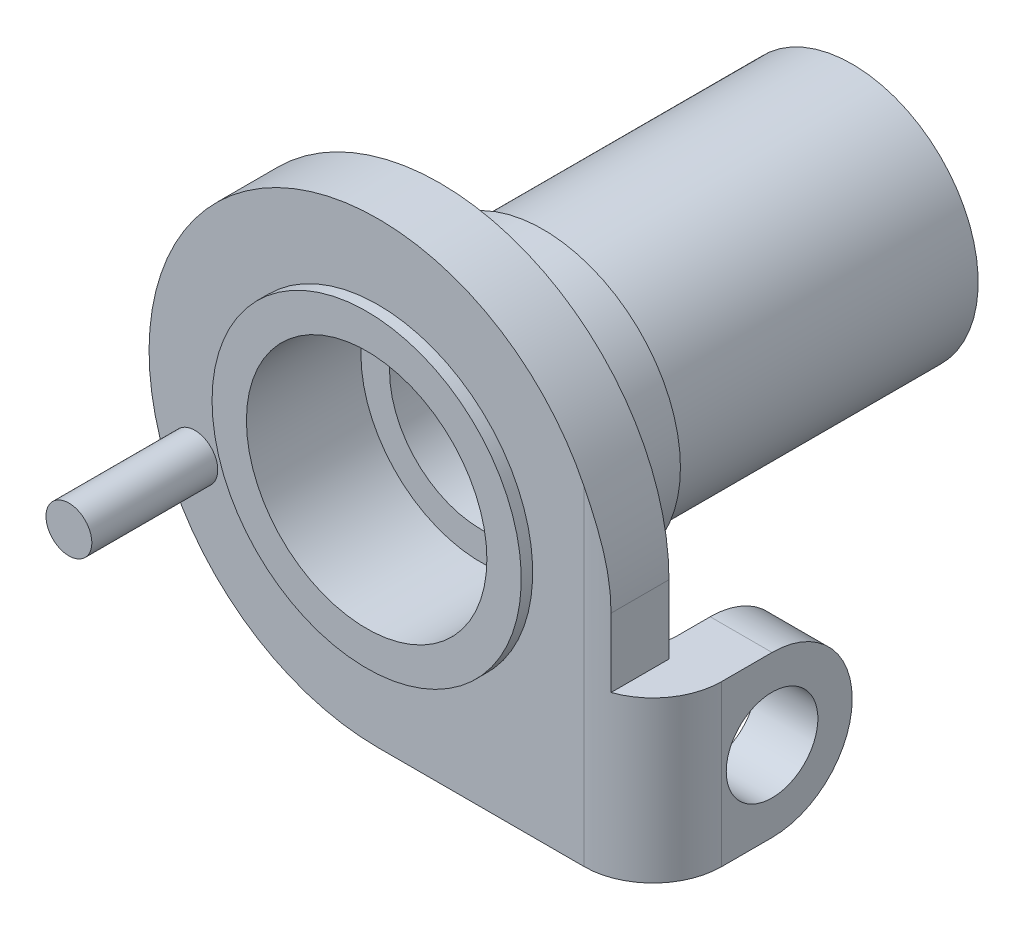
ISO-10303-21;
HEADER;
FILE_DESCRIPTION(('STEP AP214'),'2;1');
FILE_NAME('part.step','',(''),(''),'','','');
FILE_SCHEMA(('AUTOMOTIVE_DESIGN { 1 0 10303 214 1 1 1 1 }'));
ENDSEC;
DATA;
#1=APPLICATION_CONTEXT('core data for automotive mechanical design processes');
#2=APPLICATION_PROTOCOL_DEFINITION('international standard','automotive_design',2000,#1);
#3=PRODUCT_CONTEXT('',#1,'mechanical');
#4=PRODUCT('Part','Part','',(#3));
#5=PRODUCT_RELATED_PRODUCT_CATEGORY('part','',(#4));
#6=PRODUCT_DEFINITION_FORMATION('','',#4);
#7=PRODUCT_DEFINITION_CONTEXT('part definition',#1,'design');
#8=PRODUCT_DEFINITION('design','',#6,#7);
#9=PRODUCT_DEFINITION_SHAPE('','',#8);
#10=(LENGTH_UNIT() NAMED_UNIT(*) SI_UNIT(.MILLI.,.METRE.));
#11=(NAMED_UNIT(*) PLANE_ANGLE_UNIT() SI_UNIT($,.RADIAN.));
#12=(NAMED_UNIT(*) SI_UNIT($,.STERADIAN.) SOLID_ANGLE_UNIT());
#13=UNCERTAINTY_MEASURE_WITH_UNIT(LENGTH_MEASURE(1.E-05),#10,'distance_accuracy_value','');
#14=(GEOMETRIC_REPRESENTATION_CONTEXT(3) GLOBAL_UNCERTAINTY_ASSIGNED_CONTEXT((#13)) GLOBAL_UNIT_ASSIGNED_CONTEXT((#10,
#11,#12)) REPRESENTATION_CONTEXT('',''));
#15=CARTESIAN_POINT('',(0.,0.,0.));
#16=DIRECTION('',(0.,0.,1.));
#17=DIRECTION('',(1.,0.,0.));
#18=AXIS2_PLACEMENT_3D('',#15,#16,#17);
#19=CARTESIAN_POINT('',(-24.,0.,20.7));
#20=DIRECTION('',(0.,0.,1.));
#21=DIRECTION('',(-1.,0.,0.));
#22=AXIS2_PLACEMENT_3D('',#19,#20,#21);
#23=PLANE('',#22);
#24=CARTESIAN_POINT('',(-24.,0.,20.7));
#25=DIRECTION('',(0.,0.,-1.));
#26=DIRECTION('',(-1.,0.,0.));
#27=AXIS2_PLACEMENT_3D('',#24,#25,#26);
#28=CIRCLE('',#27,6.75);
#29=CARTESIAN_POINT('',(-30.75,0.,20.7));
#30=VERTEX_POINT('',#29);
#31=EDGE_CURVE('E257',#30,#30,#28,.T.);
#32=ORIENTED_EDGE('',*,*,#31,.T.);
#33=EDGE_LOOP('',(#32));
#34=FACE_BOUND('',#33,.T.);
#35=CARTESIAN_POINT('',(-24.,0.,20.7));
#36=DIRECTION('',(0.,0.,-1.));
#37=DIRECTION('',(-1.,0.,0.));
#38=AXIS2_PLACEMENT_3D('',#35,#36,#37);
#39=CIRCLE('',#38,10.);
#40=CARTESIAN_POINT('',(-24.,-10.,20.7));
#41=VERTEX_POINT('',#40);
#42=CARTESIAN_POINT('',(-15.,4.35889894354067,20.7));
#43=VERTEX_POINT('',#42);
#44=EDGE_CURVE('E272',#41,#43,#39,.T.);
#45=ORIENTED_EDGE('',*,*,#44,.F.);
#46=DIRECTION('',(-1.,0.,0.));
#47=VECTOR('',#46,1.);
#48=CARTESIAN_POINT('',(-24.,-10.,20.7));
#49=LINE('',#48,#47);
#50=CARTESIAN_POINT('',(-15.,-10.,20.7));
#51=VERTEX_POINT('',#50);
#52=EDGE_CURVE('E275',#51,#41,#49,.T.);
#53=ORIENTED_EDGE('',*,*,#52,.F.);
#54=DIRECTION('',(0.,-1.,0.));
#55=VECTOR('',#54,1.);
#56=CARTESIAN_POINT('',(-15.,-10.,20.7));
#57=LINE('',#56,#55);
#58=EDGE_CURVE('E165',#43,#51,#57,.T.);
#59=ORIENTED_EDGE('',*,*,#58,.F.);
#60=EDGE_LOOP('',(#45,#53,#59));
#61=FACE_BOUND('',#60,.T.);
#62=CARTESIAN_POINT('',(-32.,-3.,20.7));
#63=DIRECTION('',(0.,0.,-1.));
#64=DIRECTION('',(-1.,0.,0.));
#65=AXIS2_PLACEMENT_3D('',#62,#63,#64);
#66=CIRCLE('',#65,1.);
#67=CARTESIAN_POINT('',(-33.,-3.,20.7));
#68=VERTEX_POINT('',#67);
#69=EDGE_CURVE('E234',#68,#68,#66,.T.);
#70=ORIENTED_EDGE('',*,*,#69,.T.);
#71=EDGE_LOOP('',(#70));
#72=FACE_BOUND('',#71,.T.);
#73=ADVANCED_FACE('F32',(#34,#61,#72),#23,.T.);
#74=CARTESIAN_POINT('',(-24.,0.,21.2));
#75=DIRECTION('',(0.,0.,-1.));
#76=DIRECTION('',(1.,0.,0.));
#77=AXIS2_PLACEMENT_3D('',#74,#75,#76);
#78=CYLINDRICAL_SURFACE('',#77,4.);
#79=CARTESIAN_POINT('',(-24.,0.,0.));
#80=DIRECTION('',(0.,0.,1.));
#81=DIRECTION('',(1.,0.,0.));
#82=AXIS2_PLACEMENT_3D('',#79,#80,#81);
#83=CIRCLE('',#82,4.);
#84=CARTESIAN_POINT('',(-20.,0.,0.));
#85=VERTEX_POINT('',#84);
#86=EDGE_CURVE('E169',#85,#85,#83,.T.);
#87=ORIENTED_EDGE('',*,*,#86,.F.);
#88=EDGE_LOOP('',(#87));
#89=FACE_BOUND('',#88,.T.);
#90=CARTESIAN_POINT('',(-24.,0.,16.2));
#91=DIRECTION('',(0.,0.,-1.));
#92=DIRECTION('',(-1.,0.,0.));
#93=AXIS2_PLACEMENT_3D('',#90,#91,#92);
#94=CIRCLE('',#93,4.);
#95=CARTESIAN_POINT('',(-28.,0.,16.2));
#96=VERTEX_POINT('',#95);
#97=EDGE_CURVE('E166',#96,#96,#94,.F.);
#98=ORIENTED_EDGE('',*,*,#97,.T.);
#99=EDGE_LOOP('',(#98));
#100=FACE_BOUND('',#99,.T.);
#101=ADVANCED_FACE('F315',(#89,#100),#78,.F.);
#102=CARTESIAN_POINT('',(-24.,0.,13.5));
#103=DIRECTION('',(0.,0.,-1.));
#104=DIRECTION('',(1.,0.,0.));
#105=AXIS2_PLACEMENT_3D('',#102,#103,#104);
#106=CYLINDRICAL_SURFACE('',#105,5.5);
#107=CARTESIAN_POINT('',(-24.,0.,13.5));
#108=DIRECTION('',(0.,0.,-1.));
#109=DIRECTION('',(-1.,0.,0.));
#110=AXIS2_PLACEMENT_3D('',#107,#108,#109);
#111=CIRCLE('',#110,5.5);
#112=CARTESIAN_POINT('',(-29.5,0.,13.5));
#113=VERTEX_POINT('',#112);
#114=EDGE_CURVE('E162',#113,#113,#111,.T.);
#115=ORIENTED_EDGE('',*,*,#114,.T.);
#116=EDGE_LOOP('',(#115));
#117=FACE_BOUND('',#116,.T.);
#118=CARTESIAN_POINT('',(-24.,0.,0.));
#119=DIRECTION('',(0.,0.,-1.));
#120=DIRECTION('',(-1.,0.,0.));
#121=AXIS2_PLACEMENT_3D('',#118,#119,#120);
#122=CIRCLE('',#121,5.5);
#123=CARTESIAN_POINT('',(-29.5,0.,0.));
#124=VERTEX_POINT('',#123);
#125=EDGE_CURVE('E159',#124,#124,#122,.T.);
#126=ORIENTED_EDGE('',*,*,#125,.F.);
#127=EDGE_LOOP('',(#126));
#128=FACE_BOUND('',#127,.T.);
#129=ADVANCED_FACE('F321',(#117,#128),#106,.T.);
#130=CARTESIAN_POINT('',(-24.,0.,0.));
#131=DIRECTION('',(0.,0.,1.));
#132=DIRECTION('',(-1.,0.,0.));
#133=AXIS2_PLACEMENT_3D('',#130,#131,#132);
#134=PLANE('',#133);
#135=ORIENTED_EDGE('',*,*,#86,.T.);
#136=EDGE_LOOP('',(#135));
#137=FACE_BOUND('',#136,.T.);
#138=ORIENTED_EDGE('',*,*,#125,.T.);
#139=EDGE_LOOP('',(#138));
#140=FACE_BOUND('',#139,.T.);
#141=ADVANCED_FACE('F505',(#137,#140),#134,.F.);
#142=CARTESIAN_POINT('',(-24.,0.,13.5));
#143=DIRECTION('',(0.,0.,1.));
#144=DIRECTION('',(-1.,0.,0.));
#145=AXIS2_PLACEMENT_3D('',#142,#143,#144);
#146=PLANE('',#145);
#147=CARTESIAN_POINT('',(-24.,0.,13.5));
#148=DIRECTION('',(0.,0.,-1.));
#149=DIRECTION('',(-1.,0.,0.));
#150=AXIS2_PLACEMENT_3D('',#147,#148,#149);
#151=CIRCLE('',#150,6.);
#152=CARTESIAN_POINT('',(-30.,0.,13.5));
#153=VERTEX_POINT('',#152);
#154=EDGE_CURVE('E153',#153,#153,#151,.T.);
#155=ORIENTED_EDGE('',*,*,#154,.T.);
#156=EDGE_LOOP('',(#155));
#157=FACE_BOUND('',#156,.T.);
#158=ORIENTED_EDGE('',*,*,#114,.F.);
#159=EDGE_LOOP('',(#158));
#160=FACE_BOUND('',#159,.T.);
#161=ADVANCED_FACE('F495',(#157,#160),#146,.F.);
#162=CARTESIAN_POINT('',(-24.,0.,18.));
#163=DIRECTION('',(0.,0.,-1.));
#164=DIRECTION('',(1.,0.,0.));
#165=AXIS2_PLACEMENT_3D('',#162,#163,#164);
#166=CYLINDRICAL_SURFACE('',#165,6.);
#167=CARTESIAN_POINT('',(-24.,0.,18.));
#168=DIRECTION('',(0.,0.,-1.));
#169=DIRECTION('',(-1.,0.,0.));
#170=AXIS2_PLACEMENT_3D('',#167,#168,#169);
#171=CIRCLE('',#170,6.);
#172=CARTESIAN_POINT('',(-30.,0.,18.));
#173=VERTEX_POINT('',#172);
#174=EDGE_CURVE('E156',#173,#173,#171,.T.);
#175=ORIENTED_EDGE('',*,*,#174,.T.);
#176=EDGE_LOOP('',(#175));
#177=FACE_BOUND('',#176,.T.);
#178=ORIENTED_EDGE('',*,*,#154,.F.);
#179=EDGE_LOOP('',(#178));
#180=FACE_BOUND('',#179,.T.);
#181=ADVANCED_FACE('F487',(#177,#180),#166,.T.);
#182=CARTESIAN_POINT('',(-24.,0.,18.));
#183=DIRECTION('',(0.,0.,1.));
#184=DIRECTION('',(-1.,0.,0.));
#185=AXIS2_PLACEMENT_3D('',#182,#183,#184);
#186=PLANE('',#185);
#187=DIRECTION('',(-1.,0.,0.));
#188=VECTOR('',#187,1.);
#189=CARTESIAN_POINT('',(-24.,-10.,18.));
#190=LINE('',#189,#188);
#191=CARTESIAN_POINT('',(-15.7,-10.,18.));
#192=VERTEX_POINT('',#191);
#193=CARTESIAN_POINT('',(-24.,-10.,18.));
#194=VERTEX_POINT('',#193);
#195=EDGE_CURVE('E269',#192,#194,#190,.T.);
#196=ORIENTED_EDGE('',*,*,#195,.T.);
#197=CARTESIAN_POINT('',(-24.,0.,18.));
#198=DIRECTION('',(0.,0.,-1.));
#199=DIRECTION('',(-1.,0.,0.));
#200=AXIS2_PLACEMENT_3D('',#197,#198,#199);
#201=CIRCLE('',#200,10.);
#202=CARTESIAN_POINT('',(-14.,0.,18.));
#203=VERTEX_POINT('',#202);
#204=EDGE_CURVE('E263',#194,#203,#201,.T.);
#205=ORIENTED_EDGE('',*,*,#204,.T.);
#206=DIRECTION('',(0.,-1.,0.));
#207=VECTOR('',#206,1.);
#208=CARTESIAN_POINT('',(-14.,0.,18.));
#209=LINE('',#208,#207);
#210=CARTESIAN_POINT('',(-14.,-3.,18.));
#211=VERTEX_POINT('',#210);
#212=EDGE_CURVE('E266',#203,#211,#209,.T.);
#213=ORIENTED_EDGE('',*,*,#212,.T.);
#214=DIRECTION('',(1.,0.,0.));
#215=VECTOR('',#214,1.);
#216=CARTESIAN_POINT('',(-14.7,-3.,18.));
#217=LINE('',#216,#215);
#218=CARTESIAN_POINT('',(-15.7,-3.,18.));
#219=VERTEX_POINT('',#218);
#220=EDGE_CURVE('E138',#219,#211,#217,.T.);
#221=ORIENTED_EDGE('',*,*,#220,.F.);
#222=DIRECTION('',(0.,1.,0.));
#223=VECTOR('',#222,1.);
#224=CARTESIAN_POINT('',(-15.7,-3.,18.));
#225=LINE('',#224,#223);
#226=CARTESIAN_POINT('',(-15.7,-5.1771243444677,18.));
#227=VERTEX_POINT('',#226);
#228=EDGE_CURVE('E187',#227,#219,#225,.T.);
#229=ORIENTED_EDGE('',*,*,#228,.F.);
#230=CARTESIAN_POINT('',(-14.7,-8.23205079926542,16.500000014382));
#231=CARTESIAN_POINT('',(-14.7,-7.94337567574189,17.000000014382));
#232=CARTESIAN_POINT('',(-14.7,-8.23205081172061,17.500000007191));
#233=CARTESIAN_POINT('',(-14.7,-8.52072594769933,18.));
#234=CARTESIAN_POINT('',(-14.7,-9.09807621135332,18.));
#235=CARTESIAN_POINT('',(-14.7,-8.23204479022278,16.499996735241));
#236=CARTESIAN_POINT('',(-14.6832030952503,-7.94326503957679,16.9999903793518));
#237=CARTESIAN_POINT('',(-14.699957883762,-8.23196850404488,17.4999936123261));
#238=CARTESIAN_POINT('',(-14.7167171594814,-8.5206721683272,18.));
#239=CARTESIAN_POINT('',(-14.7502656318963,-9.098142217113,18.));
#240=CARTESIAN_POINT('',(-14.7,-8.23132186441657,16.5012620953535));
#241=CARTESIAN_POINT('',(-14.6665021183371,-7.94507524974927,17.0012617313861));
#242=CARTESIAN_POINT('',(-14.6999913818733,-8.23241542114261,17.5006309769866));
#243=CARTESIAN_POINT('',(-14.7334815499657,-8.5197550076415,18.));
#244=CARTESIAN_POINT('',(-14.8004891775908,-9.09370494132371,18.));
#245=CARTESIAN_POINT('',(-14.7,-8.22840362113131,16.5062984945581));
#246=CARTESIAN_POINT('',(-14.6348330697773,-7.95168645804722,17.0062825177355));
#247=CARTESIAN_POINT('',(-14.7011354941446,-8.23373908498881,17.5031421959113));
#248=CARTESIAN_POINT('',(-14.7674360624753,-8.51579118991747,18.));
#249=CARTESIAN_POINT('',(-14.8993021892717,-9.07633904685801,18.));
#250=CARTESIAN_POINT('',(-14.7,-8.22621259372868,16.5100622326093));
#251=CARTESIAN_POINT('',(-14.6198717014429,-7.95647353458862,17.010020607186));
#252=CARTESIAN_POINT('',(-14.7022429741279,-8.23461457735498,17.5050124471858));
#253=CARTESIAN_POINT('',(-14.7846104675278,-8.51275413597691,18.));
#254=CARTESIAN_POINT('',(-14.9478959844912,-9.06343517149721,18.));
#255=CARTESIAN_POINT('',(-14.7,-8.22032130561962,16.520061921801));
#256=CARTESIAN_POINT('',(-14.5931228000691,-7.96817484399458,17.0198719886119));
#257=CARTESIAN_POINT('',(-14.7064490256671,-8.23617323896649,17.509937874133));
#258=CARTESIAN_POINT('',(-14.8197721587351,-8.50417057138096,18.));
#259=CARTESIAN_POINT('',(-15.0421881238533,-9.02965318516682,18.));
#260=CARTESIAN_POINT('',(-14.7,-8.21662169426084,16.5262968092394));
#261=CARTESIAN_POINT('',(-14.5813391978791,-7.97508011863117,17.0259765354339));
#262=CARTESIAN_POINT('',(-14.7095467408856,-8.23685649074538,17.5129925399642));
#263=CARTESIAN_POINT('',(-14.8377440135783,-8.49863258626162,18.));
#264=CARTESIAN_POINT('',(-15.0878877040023,-9.00877850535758,18.));
#265=CARTESIAN_POINT('',(-14.7,-8.20762782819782,16.5411932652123));
#266=CARTESIAN_POINT('',(-14.5618376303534,-7.98958735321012,17.0403945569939));
#267=CARTESIAN_POINT('',(-14.7181852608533,-8.23701278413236,17.5202015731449));
#268=CARTESIAN_POINT('',(-14.8745226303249,-8.48443811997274,18.));
#269=CARTESIAN_POINT('',(-15.1752936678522,-8.95992663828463,18.));
#270=CARTESIAN_POINT('',(-14.7,-8.20233355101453,16.5498548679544));
#271=CARTESIAN_POINT('',(-14.5541170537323,-7.99718248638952,17.0486976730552));
#272=CARTESIAN_POINT('',(-14.7237261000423,-8.23648580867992,17.5243559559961));
#273=CARTESIAN_POINT('',(-14.8933142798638,-8.47579406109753,18.));
#274=CARTESIAN_POINT('',(-15.2169999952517,-8.93194935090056,18.));
#275=CARTESIAN_POINT('',(-14.7,-8.18980506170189,16.5699082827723));
#276=CARTESIAN_POINT('',(-14.5428832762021,-8.01179323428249,17.0676502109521));
#277=CARTESIAN_POINT('',(-14.7375326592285,-8.23310993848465,17.53383267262));
#278=CARTESIAN_POINT('',(-14.9321601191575,-8.45443218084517,18.));
#279=CARTESIAN_POINT('',(-15.2970241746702,-8.86878298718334,18.));
#280=CARTESIAN_POINT('',(-14.7,-8.18250718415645,16.5813880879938));
#281=CARTESIAN_POINT('',(-14.5395222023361,-8.01877627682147,17.0783620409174));
#282=CARTESIAN_POINT('',(-14.7458903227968,-8.23017712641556,17.5391920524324));
#283=CARTESIAN_POINT('',(-14.9522224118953,-8.44159573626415,18.));
#284=CARTESIAN_POINT('',(-15.3351631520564,-8.8333682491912,18.));
#285=CARTESIAN_POINT('',(-14.7,-8.16587980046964,16.6068314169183));
#286=CARTESIAN_POINT('',(-14.5373201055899,-8.03021966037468,17.101703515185));
#287=CARTESIAN_POINT('',(-14.7648879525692,-8.2208322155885,17.5508627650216));
#288=CARTESIAN_POINT('',(-14.9924200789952,-8.41146230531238,18.));
#289=CARTESIAN_POINT('',(-15.4057356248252,-8.75719541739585,18.));
#290=CARTESIAN_POINT('',(-14.7,-8.15654738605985,16.6207984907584));
#291=CARTESIAN_POINT('',(-14.5384691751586,-8.034682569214,17.114321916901));
#292=CARTESIAN_POINT('',(-14.7755311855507,-8.21441511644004,17.5571754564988));
#293=CARTESIAN_POINT('',(-15.0125436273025,-8.39418446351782,18.));
#294=CARTESIAN_POINT('',(-15.4381608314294,-8.71642970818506,18.));
#295=CARTESIAN_POINT('',(-14.7,-8.13439931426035,16.652893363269));
#296=CARTESIAN_POINT('',(-14.5450141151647,-8.04000820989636,17.1427728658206));
#297=CARTESIAN_POINT('',(-14.7997638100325,-8.19630455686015,17.5714043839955));
#298=CARTESIAN_POINT('',(-15.0544525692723,-8.35264671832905,18.));
#299=CARTESIAN_POINT('',(-15.5004639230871,-8.62577320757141,18.));
#300=CARTESIAN_POINT('',(-14.7,-8.12130352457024,16.6713170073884));
#301=CARTESIAN_POINT('',(-14.5508699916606,-8.0404093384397,17.1587987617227));
#302=CARTESIAN_POINT('',(-14.8135523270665,-8.18408060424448,17.579421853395));
#303=CARTESIAN_POINT('',(-15.07615874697,-8.32783329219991,18.));
#304=CARTESIAN_POINT('',(-15.5295972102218,-8.57537293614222,18.));
#305=CARTESIAN_POINT('',(-14.7,-8.09194100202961,16.7109213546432));
#306=CARTESIAN_POINT('',(-14.5661559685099,-8.0349790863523,17.1924845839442));
#307=CARTESIAN_POINT('',(-14.841975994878,-8.15368016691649,17.5962644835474));
#308=CARTESIAN_POINT('',(-15.1177211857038,-8.27246106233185,18.));
#309=CARTESIAN_POINT('',(-15.5803886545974,-8.47112959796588,18.));
#310=CARTESIAN_POINT('',(-14.7,-8.07568183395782,16.7320954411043));
#311=CARTESIAN_POINT('',(-14.5755550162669,-8.02919650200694,17.2101235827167));
#312=CARTESIAN_POINT('',(-14.8566090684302,-8.1355178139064,17.6050876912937));
#313=CARTESIAN_POINT('',(-15.1375810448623,-8.24195993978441,18.));
#314=CARTESIAN_POINT('',(-15.6020643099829,-8.41729494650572,18.));
#315=CARTESIAN_POINT('',(-14.7,-8.04349006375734,16.7720625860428));
#316=CARTESIAN_POINT('',(-14.5942695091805,-8.01264318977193,17.2426787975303));
#317=CARTESIAN_POINT('',(-14.8824740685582,-8.09769481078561,17.6213551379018));
#318=CARTESIAN_POINT('',(-15.1706283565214,-8.1828193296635,18.));
#319=CARTESIAN_POINT('',(-15.6344599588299,-8.31947268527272,18.));
#320=CARTESIAN_POINT('',(-14.7,-8.02827232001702,16.7903548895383));
#321=CARTESIAN_POINT('',(-14.6031308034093,-8.00328058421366,17.2573173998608));
#322=CARTESIAN_POINT('',(-14.8937461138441,-8.07924250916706,17.6286757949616));
#323=CARTESIAN_POINT('',(-15.1843110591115,-8.15529743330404,18.));
#324=CARTESIAN_POINT('',(-15.6465410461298,-8.27592383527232,18.));
#325=CARTESIAN_POINT('',(-14.7,-7.99533805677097,16.8283815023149));
#326=CARTESIAN_POINT('',(-14.6216101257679,-7.98006988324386,17.2872057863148));
#327=CARTESIAN_POINT('',(-14.9157444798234,-8.03858115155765,17.6436199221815));
#328=CARTESIAN_POINT('',(-15.209828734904,-8.09718511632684,18.));
#329=CARTESIAN_POINT('',(-15.6667946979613,-8.18789602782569,18.));
#330=CARTESIAN_POINT('',(-14.7,-7.97761949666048,16.8481169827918));
#331=CARTESIAN_POINT('',(-14.6312240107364,-7.96624018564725,17.3024511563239));
#332=CARTESIAN_POINT('',(-14.9264703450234,-8.01636902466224,17.6512436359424));
#333=CARTESIAN_POINT('',(-15.2216687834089,-8.06661029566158,18.));
#334=CARTESIAN_POINT('',(-15.6749640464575,-8.14341633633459,18.));
#335=CARTESIAN_POINT('',(-14.7,-7.93926935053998,16.8889908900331));
#336=CARTESIAN_POINT('',(-14.6507379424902,-7.93388226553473,17.3334641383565));
#337=CARTESIAN_POINT('',(-14.9470852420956,-7.96811425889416,17.6667502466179));
#338=CARTESIAN_POINT('',(-15.2433840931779,-8.00245933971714,18.));
#339=CARTESIAN_POINT('',(-15.6877887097,-8.05363212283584,18.));
#340=CARTESIAN_POINT('',(-14.7,-7.91861730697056,16.9101385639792));
#341=CARTESIAN_POINT('',(-14.6606380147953,-7.91534277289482,17.3492319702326));
#342=CARTESIAN_POINT('',(-14.9569675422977,-7.94204466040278,17.6746346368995));
#343=CARTESIAN_POINT('',(-15.2532533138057,-7.96887764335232,18.));
#344=CARTESIAN_POINT('',(-15.6924177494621,-8.008323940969,18.));
#345=CARTESIAN_POINT('',(-14.7,-7.87421258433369,16.953443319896));
#346=CARTESIAN_POINT('',(-14.680194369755,-7.87363445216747,17.3809547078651));
#347=CARTESIAN_POINT('',(-14.9755377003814,-7.88637138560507,17.690496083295));
#348=CARTESIAN_POINT('',(-15.2708372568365,-7.8992396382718,18.));
#349=CARTESIAN_POINT('',(-15.6984836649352,-7.91755351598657,18.));
#350=CARTESIAN_POINT('',(-14.7,-7.85046315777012,16.9755993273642));
#351=CARTESIAN_POINT('',(-14.6898516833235,-7.85049289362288,17.3969079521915));
#352=CARTESIAN_POINT('',(-14.9842267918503,-7.85677141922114,17.6984730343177));
#353=CARTESIAN_POINT('',(-15.2785639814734,-7.86319878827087,18.));
#354=CARTESIAN_POINT('',(-15.6999238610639,-7.87209148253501,18.));
#355=CARTESIAN_POINT('',(-14.7,-7.77215123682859,17.0448733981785));
#356=CARTESIAN_POINT('',(-14.7185305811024,-7.77246374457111,17.4458122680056));
#357=CARTESIAN_POINT('',(-15.008834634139,-7.76054979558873,17.7229850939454));
#358=CARTESIAN_POINT('',(-15.2989794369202,-7.74925736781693,18.));
#359=CARTESIAN_POINT('',(-15.7001483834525,-7.73236502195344,18.));
#360=CARTESIAN_POINT('',(-14.7,-7.71187919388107,17.0932562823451));
#361=CARTESIAN_POINT('',(-14.7366457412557,-7.7098939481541,17.4788845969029));
#362=CARTESIAN_POINT('',(-15.0225014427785,-7.68829561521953,17.739514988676));
#363=CARTESIAN_POINT('',(-15.3082638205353,-7.66742035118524,18.));
#364=CARTESIAN_POINT('',(-15.6944221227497,-7.6381002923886,18.));
#365=CARTESIAN_POINT('',(-14.7,-7.57338057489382,17.1896673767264));
#366=CARTESIAN_POINT('',(-14.7682813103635,-7.5655180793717,17.5426948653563));
#367=CARTESIAN_POINT('',(-15.0436928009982,-7.53036579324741,17.7714197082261));
#368=CARTESIAN_POINT('',(-15.3190050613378,-7.49592563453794,18.));
#369=CARTESIAN_POINT('',(-15.6756456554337,-7.45021490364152,18.));
#370=CARTESIAN_POINT('',(-14.7,-7.49510623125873,17.2376942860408));
#371=CARTESIAN_POINT('',(-14.7818443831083,-7.4837732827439,17.5734747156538));
#372=CARTESIAN_POINT('',(-15.0512007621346,-7.44465464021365,17.7867913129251));
#373=CARTESIAN_POINT('',(-15.3205163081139,-7.4062450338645,18.));
#374=CARTESIAN_POINT('',(-15.6625758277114,-7.35659665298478,18.));
#375=CARTESIAN_POINT('',(-14.7,-7.36288394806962,17.3049537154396));
#376=CARTESIAN_POINT('',(-14.798409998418,-7.34769127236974,17.6155552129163));
#377=CARTESIAN_POINT('',(-15.0587672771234,-7.30711492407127,17.8077915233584));
#378=CARTESIAN_POINT('',(-15.3191154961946,-7.26671973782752,18.));
#379=CARTESIAN_POINT('',(-15.6413491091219,-7.21650773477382,18.));
#380=CARTESIAN_POINT('',(-14.7,-7.31638019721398,17.3265628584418));
#381=CARTESIAN_POINT('',(-14.8032946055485,-7.3002569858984,17.6288680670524));
#382=CARTESIAN_POINT('',(-15.0606734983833,-7.25981014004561,17.8144446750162));
#383=CARTESIAN_POINT('',(-15.3180477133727,-7.21953042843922,18.));
#384=CARTESIAN_POINT('',(-15.6340090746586,-7.16990127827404,18.));
#385=CARTESIAN_POINT('',(-14.7,-7.21847416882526,17.3672457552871));
#386=CARTESIAN_POINT('',(-14.8118688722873,-7.20129742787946,17.6536549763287));
#387=CARTESIAN_POINT('',(-15.0635325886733,-7.16240268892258,17.8268379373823));
#388=CARTESIAN_POINT('',(-15.3151912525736,-7.1236723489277,18.));
#389=CARTESIAN_POINT('',(-15.619505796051,-7.0766611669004,18.));
#390=CARTESIAN_POINT('',(-14.7,-7.16707216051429,17.3863196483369));
#391=CARTESIAN_POINT('',(-14.815564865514,-7.14976069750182,17.6651417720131));
#392=CARTESIAN_POINT('',(-15.0644855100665,-7.11230017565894,17.8325780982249));
#393=CARTESIAN_POINT('',(-15.3134043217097,-7.07498391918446,18.));
#394=CARTESIAN_POINT('',(-15.6123425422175,-7.03002751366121,18.));
#395=CARTESIAN_POINT('',(-14.7,-7.05982154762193,17.420875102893));
#396=CARTESIAN_POINT('',(-14.8218463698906,-7.04318604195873,17.6857663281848));
#397=CARTESIAN_POINT('',(-15.0657397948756,-7.00972407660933,17.8428904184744));
#398=CARTESIAN_POINT('',(-15.3096315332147,-6.97640564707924,18.));
#399=CARTESIAN_POINT('',(-15.5989476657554,-6.93674234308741,18.));
#400=CARTESIAN_POINT('',(-14.7,-7.00398451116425,17.4363656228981));
#401=CARTESIAN_POINT('',(-14.8244397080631,-6.98813393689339,17.6949229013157));
#402=CARTESIAN_POINT('',(-15.0660427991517,-6.95725680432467,17.8474654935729));
#403=CARTESIAN_POINT('',(-15.307645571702,-6.92649187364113,18.));
#404=CARTESIAN_POINT('',(-15.5927137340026,-6.89009116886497,18.));
#405=CARTESIAN_POINT('',(-14.7,-6.88851764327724,17.462793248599));
#406=CARTESIAN_POINT('',(-14.8286487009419,-6.87513329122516,17.7104441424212));
#407=CARTESIAN_POINT('',(-15.0663190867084,-6.85030705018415,17.8552261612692));
#408=CARTESIAN_POINT('',(-15.3039892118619,-6.82559276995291,18.));
#409=CARTESIAN_POINT('',(-15.5818718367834,-6.79659705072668,18.));
#410=CARTESIAN_POINT('',(-14.7,-6.82888819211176,17.4737308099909));
#411=CARTESIAN_POINT('',(-14.8302680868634,-6.81714845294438,17.7168207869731));
#412=CARTESIAN_POINT('',(-15.0662924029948,-6.79582477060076,17.858411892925));
#413=CARTESIAN_POINT('',(-15.3023167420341,-6.77457170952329,18.));
#414=CARTESIAN_POINT('',(-15.5772637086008,-6.74975412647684,18.));
#415=CARTESIAN_POINT('',(-14.7,-6.70662659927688,17.4902601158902));
#416=CARTESIAN_POINT('',(-14.8326478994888,-6.69884906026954,17.7264220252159));
#417=CARTESIAN_POINT('',(-15.066178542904,-6.68510359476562,17.863212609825));
#418=CARTESIAN_POINT('',(-15.2997093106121,-6.67143033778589,18.));
#419=CARTESIAN_POINT('',(-15.5702378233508,-6.65553043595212,18.));
#420=CARTESIAN_POINT('',(-14.7,-6.64397472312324,17.4958096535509));
#421=CARTESIAN_POINT('',(-14.8334037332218,-6.6384703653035,17.7296301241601));
#422=CARTESIAN_POINT('',(-15.0660908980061,-6.62885433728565,17.864815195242));
#423=CARTESIAN_POINT('',(-15.2987780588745,-6.61926015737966,18.));
#424=CARTESIAN_POINT('',(-15.5678373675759,-6.60814831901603,18.));
#425=CARTESIAN_POINT('',(-14.7,-6.51785535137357,17.5009153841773));
#426=CARTESIAN_POINT('',(-14.834100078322,-6.51715573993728,17.7325795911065));
#427=CARTESIAN_POINT('',(-15.0660120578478,-6.51593114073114,17.8662899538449));
#428=CARTESIAN_POINT('',(-15.2979240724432,-6.51472932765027,18.));
#429=CARTESIAN_POINT('',(-15.5656303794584,-6.51332369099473,18.));
#430=CARTESIAN_POINT('',(-14.7,-6.45438790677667,17.500471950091));
#431=CARTESIAN_POINT('',(-14.8340412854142,-6.45616382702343,17.7323239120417));
#432=CARTESIAN_POINT('',(-15.0660208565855,-6.45925722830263,17.8661622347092));
#433=CARTESIAN_POINT('',(-15.2980004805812,-6.46232030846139,18.));
#434=CARTESIAN_POINT('',(-15.5658236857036,-6.46588118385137,18.));
#435=CARTESIAN_POINT('',(-14.7,-6.32844940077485,17.4936287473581));
#436=CARTESIAN_POINT('',(-14.8331038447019,-6.33496559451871,17.7283690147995));
#437=CARTESIAN_POINT('',(-15.0661218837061,-6.34639361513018,17.8641847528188));
#438=CARTESIAN_POINT('',(-15.2991399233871,-6.35779212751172,18.));
#439=CARTESIAN_POINT('',(-15.5687778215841,-6.3710062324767,18.));
#440=CARTESIAN_POINT('',(-14.7,-6.26598004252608,17.4872197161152));
#441=CARTESIAN_POINT('',(-14.8322230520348,-6.27470504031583,17.7246607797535));
#442=CARTESIAN_POINT('',(-15.0662142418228,-6.29020480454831,17.8623323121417));
#443=CARTESIAN_POINT('',(-15.3002055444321,-6.30562538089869,18.));
#444=CARTESIAN_POINT('',(-15.571542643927,-6.32357391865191,18.));
#445=CARTESIAN_POINT('',(-14.7,-6.14383442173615,17.4690008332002));
#446=CARTESIAN_POINT('',(-14.8295672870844,-6.15635493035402,17.7140643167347));
#447=CARTESIAN_POINT('',(-15.0663028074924,-6.17929227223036,17.8570340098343));
#448=CARTESIAN_POINT('',(-15.3030383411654,-6.20215080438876,18.));
#449=CARTESIAN_POINT('',(-15.5792553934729,-6.22888869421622,18.));
#450=CARTESIAN_POINT('',(-14.7,-6.0841585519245,17.4571902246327));
#451=CARTESIAN_POINT('',(-14.8277897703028,-6.09821784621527,17.7071665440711));
#452=CARTESIAN_POINT('',(-15.0662990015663,-6.12456875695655,17.853587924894));
#453=CARTESIAN_POINT('',(-15.3048078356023,-6.15079979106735,18.));
#454=CARTESIAN_POINT('',(-15.5842036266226,-6.18163580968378,18.));
#455=CARTESIAN_POINT('',(-14.7,-5.96855432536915,17.4290222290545));
#456=CARTESIAN_POINT('',(-14.8232161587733,-5.9848325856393,17.6905861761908));
#457=CARTESIAN_POINT('',(-15.0659048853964,-6.01700997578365,17.8452977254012));
#458=CARTESIAN_POINT('',(-15.3085931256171,-6.0490661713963,18.));
#459=CARTESIAN_POINT('',(-15.5956736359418,-6.08709656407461,18.));
#460=CARTESIAN_POINT('',(-14.7,-5.91264556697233,17.4126430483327));
#461=CARTESIAN_POINT('',(-14.8204111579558,-5.92956442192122,17.6808777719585));
#462=CARTESIAN_POINT('',(-15.0655126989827,-5.96418516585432,17.8404469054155));
#463=CARTESIAN_POINT('',(-15.3106120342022,-5.9986540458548,18.));
#464=CARTESIAN_POINT('',(-15.6022029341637,-6.03981115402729,18.));
#465=CARTESIAN_POINT('',(-14.7,-5.80560111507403,17.3764344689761));
#466=CARTESIAN_POINT('',(-14.8136649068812,-5.82288902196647,17.6591965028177));
#467=CARTESIAN_POINT('',(-15.0640076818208,-5.86115661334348,17.8296062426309));
#468=CARTESIAN_POINT('',(-15.3143482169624,-5.89927173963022,18.));
#469=CARTESIAN_POINT('',(-15.6160674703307,-5.94536137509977,18.));
#470=CARTESIAN_POINT('',(-14.7,-5.75446559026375,17.3566049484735));
#471=CARTESIAN_POINT('',(-14.8097181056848,-5.77145946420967,17.6472099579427));
#472=CARTESIAN_POINT('',(-15.0628948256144,-5.81095296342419,17.823616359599));
#473=CARTESIAN_POINT('',(-15.3160657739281,-5.85027430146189,18.));
#474=CARTESIAN_POINT('',(-15.6234027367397,-5.8981970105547,18.));
#475=CARTESIAN_POINT('',(-14.7,-5.65726729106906,17.3145539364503));
#476=CARTESIAN_POINT('',(-14.8006013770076,-5.67290794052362,17.6214805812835));
#477=CARTESIAN_POINT('',(-15.0596381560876,-5.71348334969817,17.8107516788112));
#478=CARTESIAN_POINT('',(-15.3186691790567,-5.75388590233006,18.));
#479=CARTESIAN_POINT('',(-15.6381109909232,-5.80390183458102,18.));
#480=CARTESIAN_POINT('',(-14.7,-5.61120167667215,17.292333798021));
#481=CARTESIAN_POINT('',(-14.7954254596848,-5.62577356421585,17.607725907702));
#482=CARTESIAN_POINT('',(-15.0574949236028,-5.66621574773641,17.8038773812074));
#483=CARTESIAN_POINT('',(-15.31955321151,-5.70647502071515,18.));
#484=CARTESIAN_POINT('',(-15.6454839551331,-5.75677101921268,18.));
#485=CARTESIAN_POINT('',(-14.7,-5.52408202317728,17.2464277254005));
#486=CARTESIAN_POINT('',(-14.7838131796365,-5.53604460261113,17.5789146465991));
#487=CARTESIAN_POINT('',(-15.051921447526,-5.57478801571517,17.7894717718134));
#488=CARTESIAN_POINT('',(-15.320018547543,-5.6133478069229,18.));
#489=CARTESIAN_POINT('',(-15.6595461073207,-5.66240787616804,18.));
#490=CARTESIAN_POINT('',(-14.7,-5.48302748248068,17.222741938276));
#491=CARTESIAN_POINT('',(-14.7773695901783,-5.4934502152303,17.5638472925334));
#492=CARTESIAN_POINT('',(-15.0484913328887,-5.53062757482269,17.781940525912));
#493=CARTESIAN_POINT('',(-15.319594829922,-5.56761983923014,18.));
#494=CARTESIAN_POINT('',(-15.6662353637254,-5.61517555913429,18.));
#495=CARTESIAN_POINT('',(-14.7,-5.42306613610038,17.1854797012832));
#496=CARTESIAN_POINT('',(-14.7664378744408,-5.43110299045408,17.5398054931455));
#497=CARTESIAN_POINT('',(-15.0420342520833,-5.4646706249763,17.7699079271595));
#498=CARTESIAN_POINT('',(-15.3176251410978,-5.49818148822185,18.));
#499=CARTESIAN_POINT('',(-15.6755576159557,-5.54178354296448,18.));
#500=CARTESIAN_POINT('',(-14.7,-5.40249196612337,17.1721394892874));
#501=CARTESIAN_POINT('',(-14.7623632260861,-5.40965011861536,17.531118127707));
#502=CARTESIAN_POINT('',(-15.0395178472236,-5.44173588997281,17.765564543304));
#503=CARTESIAN_POINT('',(-15.3166656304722,-5.47376574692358,18.));
#504=CARTESIAN_POINT('',(-15.6786632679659,-5.51568480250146,18.));
#505=CARTESIAN_POINT('',(-14.7,-5.36274189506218,17.1453626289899));
#506=CARTESIAN_POINT('',(-14.7538595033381,-5.36819606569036,17.5135287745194));
#507=CARTESIAN_POINT('',(-15.0340220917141,-5.3968827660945,17.7567698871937));
#508=CARTESIAN_POINT('',(-15.3141777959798,-5.42551339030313,18.));
#509=CARTESIAN_POINT('',(-15.6843569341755,-5.46342774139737,18.));
#510=CARTESIAN_POINT('',(-14.7,-5.34356618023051,17.1319259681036));
#511=CARTESIAN_POINT('',(-14.749429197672,-5.34819726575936,17.5046256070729));
#512=CARTESIAN_POINT('',(-15.0310426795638,-5.37496451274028,17.7523186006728));
#513=CARTESIAN_POINT('',(-15.3126478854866,-5.40167661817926,18.));
#514=CARTESIAN_POINT('',(-15.6869448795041,-5.43726941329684,18.));
#515=CARTESIAN_POINT('',(-14.7,-5.28811804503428,17.091674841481));
#516=CARTESIAN_POINT('',(-14.735639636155,-5.29040742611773,17.4776787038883));
#517=CARTESIAN_POINT('',(-15.0214014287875,-5.31085147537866,17.7388623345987));
#518=CARTESIAN_POINT('',(-15.3071302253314,-5.3310763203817,18.));
#519=CARTESIAN_POINT('',(-15.6937679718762,-5.35879745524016,18.));
#520=CARTESIAN_POINT('',(-14.7,-5.2538508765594,17.0648724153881));
#521=CARTESIAN_POINT('',(-14.7257966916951,-5.25491011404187,17.4594309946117));
#522=CARTESIAN_POINT('',(-15.0140286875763,-5.27021666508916,17.7297398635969));
#523=CARTESIAN_POINT('',(-15.302216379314,-5.28531912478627,18.));
#524=CARTESIAN_POINT('',(-15.6970746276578,-5.30639609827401,18.));
#525=CARTESIAN_POINT('',(-14.7,-5.19029703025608,17.0120773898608));
#526=CARTESIAN_POINT('',(-14.7051421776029,-5.19005695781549,17.4227968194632));
#527=CARTESIAN_POINT('',(-14.9974366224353,-5.19349753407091,17.7114227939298));
#528=CARTESIAN_POINT('',(-15.2896870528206,-5.19673382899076,18.));
#529=CARTESIAN_POINT('',(-15.7004221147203,-5.20166976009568,18.));
#530=CARTESIAN_POINT('',(-14.7,-5.16099245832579,16.9860821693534));
#531=CARTESIAN_POINT('',(-14.6943276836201,-5.16070692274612,17.4044077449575));
#532=CARTESIAN_POINT('',(-14.9882242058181,-5.15739699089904,17.7022285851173));
#533=CARTESIAN_POINT('',(-15.2820663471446,-5.15390475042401,18.));
#534=CARTESIAN_POINT('',(-15.7004749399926,-5.14934520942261,18.));
#535=CARTESIAN_POINT('',(-14.7,-5.10669308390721,16.9352972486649));
#536=CARTESIAN_POINT('',(-14.6721601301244,-5.10806792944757,17.3677697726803));
#537=CARTESIAN_POINT('',(-14.9681107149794,-5.08980452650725,17.6839097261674));
#538=CARTESIAN_POINT('',(-15.2640068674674,-5.07135775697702,18.));
#539=CARTESIAN_POINT('',(-15.6966259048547,-5.04480789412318,18.));
#540=CARTESIAN_POINT('',(-14.7,-5.08169927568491,16.9105078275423));
#541=CARTESIAN_POINT('',(-14.6608040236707,-5.08481337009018,17.3495216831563));
#542=CARTESIAN_POINT('',(-14.9572092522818,-5.05831366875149,17.67478509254));
#543=CARTESIAN_POINT('',(-15.2535521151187,-5.03165751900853,18.));
#544=CARTESIAN_POINT('',(-15.6927231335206,-4.99259515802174,18.));
#545=CARTESIAN_POINT('',(-14.7,-5.04166050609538,16.8688841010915));
#546=CARTESIAN_POINT('',(-14.6411999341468,-5.04977418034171,17.3182846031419));
#547=CARTESIAN_POINT('',(-14.9371343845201,-5.00788334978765,17.6591555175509));
#548=CARTESIAN_POINT('',(-15.2330349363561,-4.96590719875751,18.));
#549=CARTESIAN_POINT('',(-15.6819451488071,-4.90246889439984,18.));
#550=CARTESIAN_POINT('',(-14.7,-5.02573362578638,16.8516814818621));
#551=CARTESIAN_POINT('',(-14.6329156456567,-5.03658090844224,17.3051681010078));
#552=CARTESIAN_POINT('',(-14.9282677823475,-4.98782837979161,17.6525966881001));
#553=CARTESIAN_POINT('',(-15.2235844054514,-4.93900248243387,18.));
#554=CARTESIAN_POINT('',(-15.6761306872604,-4.86443001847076,18.));
#555=CARTESIAN_POINT('',(-14.7,-4.99577741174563,16.8182629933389));
#556=CARTESIAN_POINT('',(-14.6167123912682,-5.0134489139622,17.2793077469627));
#557=CARTESIAN_POINT('',(-14.9100174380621,-4.95040968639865,17.63966662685));
#558=CARTESIAN_POINT('',(-15.2032863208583,-4.8872968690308,18.));
#559=CARTESIAN_POINT('',(-15.6617790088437,-4.7888835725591,18.));
#560=CARTESIAN_POINT('',(-14.7,-4.98174775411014,16.8020469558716));
#561=CARTESIAN_POINT('',(-14.6087955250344,-5.00352349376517,17.2665664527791));
#562=CARTESIAN_POINT('',(-14.9006337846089,-4.93304550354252,17.6332953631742));
#563=CARTESIAN_POINT('',(-15.1924344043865,-4.86250620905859,18.));
#564=CARTESIAN_POINT('',(-15.6532422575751,-4.75137591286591,18.));
#565=CARTESIAN_POINT('',(-14.7,-4.94217128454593,16.7549347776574));
#566=CARTESIAN_POINT('',(-14.5860223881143,-4.97842988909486,17.228925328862));
#567=CARTESIAN_POINT('',(-14.8720018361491,-4.8849750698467,17.6145108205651));
#568=CARTESIAN_POINT('',(-15.1578357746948,-4.79127214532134,18.));
#569=CARTESIAN_POINT('',(-15.6231496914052,-4.63981210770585,18.));
#570=CARTESIAN_POINT('',(-14.7,-4.91919931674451,16.7256414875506));
#571=CARTESIAN_POINT('',(-14.5722869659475,-4.9681761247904,17.2048241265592));
#572=CARTESIAN_POINT('',(-14.8523061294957,-4.8583715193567,17.6024520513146));
#573=CARTESIAN_POINT('',(-15.1321918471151,-4.7484168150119,18.));
#574=CARTESIAN_POINT('',(-15.5971269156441,-4.56686017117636,18.));
#575=CARTESIAN_POINT('',(-14.7,-4.88303410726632,16.6773432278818));
#576=CARTESIAN_POINT('',(-14.5529255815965,-4.95975313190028,17.1640005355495));
#577=CARTESIAN_POINT('',(-14.8180145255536,-4.82011229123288,17.5820265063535));
#578=CARTESIAN_POINT('',(-15.0830147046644,-4.68037339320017,18.));
#579=CARTESIAN_POINT('',(-15.5385547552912,-4.44092564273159,18.));
#580=CARTESIAN_POINT('',(-14.7,-4.86880459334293,16.6574509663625));
#581=CARTESIAN_POINT('',(-14.5462486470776,-4.95962878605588,17.1467637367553));
#582=CARTESIAN_POINT('',(-14.8031838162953,-4.80653538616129,17.5734025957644));
#583=CARTESIAN_POINT('',(-15.060048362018,-4.65338810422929,18.));
#584=CARTESIAN_POINT('',(-15.5083351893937,-4.38685838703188,18.));
#585=CARTESIAN_POINT('',(-14.7,-4.84357191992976,16.6210423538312));
#586=CARTESIAN_POINT('',(-14.5382603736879,-4.96495080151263,17.1145630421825));
#587=CARTESIAN_POINT('',(-14.7757333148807,-4.78549920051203,17.55730219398));
#588=CARTESIAN_POINT('',(-15.0131357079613,-4.60599329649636,18.));
#589=CARTESIAN_POINT('',(-15.4394463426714,-4.28446074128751,18.));
#590=CARTESIAN_POINT('',(-14.7,-4.83256292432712,16.6045199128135));
#591=CARTESIAN_POINT('',(-14.5369695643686,-4.97041392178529,17.0996174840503));
#592=CARTESIAN_POINT('',(-14.7631095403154,-4.77802880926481,17.5498236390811));
#593=CARTESIAN_POINT('',(-14.9892018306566,-4.5856215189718,18.));
#594=CARTESIAN_POINT('',(-15.400792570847,-4.23612006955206,18.));
#595=CARTESIAN_POINT('',(-14.7,-4.81329164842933,16.5748626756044));
#596=CARTESIAN_POINT('',(-14.5408338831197,-4.98472065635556,17.0723097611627));
#597=CARTESIAN_POINT('',(-14.7410871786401,-4.76781904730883,17.5361701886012));
#598=CARTESIAN_POINT('',(-14.9412907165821,-4.5508944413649,18.));
#599=CARTESIAN_POINT('',(-15.3150808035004,-4.14677586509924,18.));
#600=CARTESIAN_POINT('',(-14.7,-4.80505109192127,16.5617548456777));
#601=CARTESIAN_POINT('',(-14.5460658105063,-4.99359844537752,17.0599927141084));
#602=CARTESIAN_POINT('',(-14.7317140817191,-4.76511641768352,17.5300057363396));
#603=CARTESIAN_POINT('',(-14.9173367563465,-4.53662987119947,18.));
#604=CARTESIAN_POINT('',(-15.2679605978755,-4.10583147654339,18.));
#605=CARTESIAN_POINT('',(-14.7,-4.79113982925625,16.539217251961));
#606=CARTESIAN_POINT('',(-14.5632691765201,-5.01189185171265,17.0385138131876));
#607=CARTESIAN_POINT('',(-14.7168665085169,-4.76267835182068,17.5192664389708));
#608=CARTESIAN_POINT('',(-14.8704371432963,-4.51346078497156,18.));
#609=CARTESIAN_POINT('',(-15.166583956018,-4.03383399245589,18.));
#610=CARTESIAN_POINT('',(-14.7,-4.78547004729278,16.529788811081));
#611=CARTESIAN_POINT('',(-14.5752579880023,-5.0213001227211,17.0293753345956));
#612=CARTESIAN_POINT('',(-14.7113934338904,-4.76294398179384,17.5146921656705));
#613=CARTESIAN_POINT('',(-14.8475196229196,-4.5045891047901,18.));
#614=CARTESIAN_POINT('',(-15.1123249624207,-4.00278445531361,18.));
#615=CARTESIAN_POINT('',(-14.7,-4.77708895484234,16.5156942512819));
#616=CARTESIAN_POINT('',(-14.6029236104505,-5.03670563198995,17.0155864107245));
#617=CARTESIAN_POINT('',(-14.7044018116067,-4.76433357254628,17.5077966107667));
#618=CARTESIAN_POINT('',(-14.8058732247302,-4.49196336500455,18.));
#619=CARTESIAN_POINT('',(-15.0059543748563,-3.95570733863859,18.));
#620=CARTESIAN_POINT('',(-14.7,-4.77409043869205,16.5105708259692));
#621=CARTESIAN_POINT('',(-14.6179269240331,-5.0429774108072,17.0105196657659));
#622=CARTESIAN_POINT('',(-14.7024643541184,-4.7653424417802,17.5052608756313));
#623=CARTESIAN_POINT('',(-14.7870003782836,-4.48770828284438,18.));
#624=CARTESIAN_POINT('',(-14.95446800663,-3.93825902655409,18.));
#625=CARTESIAN_POINT('',(-14.7,-4.76982329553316,16.5032483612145));
#626=CARTESIAN_POINT('',(-14.6505856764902,-5.05223177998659,17.0032477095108));
#627=CARTESIAN_POINT('',(-14.7002966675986,-4.76699685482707,17.5016250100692));
#628=CARTESIAN_POINT('',(-14.7500064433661,-4.48176311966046,18.));
#629=CARTESIAN_POINT('',(-14.8492610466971,-3.91318599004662,18.));
#630=CARTESIAN_POINT('',(-14.7,-4.76854929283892,16.5010402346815));
#631=CARTESIAN_POINT('',(-14.66822057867,-5.05521629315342,17.0010404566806));
#632=CARTESIAN_POINT('',(-14.7000611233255,-4.76764352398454,17.500520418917));
#633=CARTESIAN_POINT('',(-14.731901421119,-4.48007093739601,18.));
#634=CARTESIAN_POINT('',(-14.7955479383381,-3.90553074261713,18.));
#635=CARTESIAN_POINT('',(-14.7,-4.7680049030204,16.5000962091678));
#636=CARTESIAN_POINT('',(-14.6907367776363,-5.05649712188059,17.0000960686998));
#637=CARTESIAN_POINT('',(-14.6999994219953,-4.76792328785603,17.5000480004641));
#638=CARTESIAN_POINT('',(-14.7092621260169,-4.47934942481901,18.));
#639=CARTESIAN_POINT('',(-14.7277883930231,-3.90225586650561,18.));
#640=CARTESIAN_POINT('',(-14.7,-4.76794922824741,16.4999995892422));
#641=CARTESIAN_POINT('',(-14.6953689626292,-5.0566288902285,16.9999993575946));
#642=CARTESIAN_POINT('',(-14.6999991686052,-4.7679524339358,17.4999996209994));
#643=CARTESIAN_POINT('',(-14.7046294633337,-4.4792759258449,18.));
#644=CARTESIAN_POINT('',(-14.713890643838,-3.90192036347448,18.));
#645=CARTESIAN_POINT('',(-14.7,-4.76794919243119,16.5000000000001));
#646=CARTESIAN_POINT('',(-14.7,-5.05662432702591,17.0000000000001));
#647=CARTESIAN_POINT('',(-14.7,-4.76794919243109,17.5000000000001));
#648=CARTESIAN_POINT('',(-14.7,-4.47927405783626,18.));
#649=CARTESIAN_POINT('',(-14.7,-3.90192378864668,18.));
#650=(BOUNDED_SURFACE() B_SPLINE_SURFACE(3,2,((#230,#231,#232,#233,#234),(#235,#236,#237,#238,
#239),(#240,#241,#242,#243,#244),(#245,#246,#247,#248,#249),(#250,#251,#252,#253,#254),(#255,
#256,#257,#258,#259),(#260,#261,#262,#263,#264),(#265,#266,#267,#268,#269),(#270,#271,#272,#273,
#274),(#275,#276,#277,#278,#279),(#280,#281,#282,#283,#284),(#285,#286,#287,#288,#289),(#290,
#291,#292,#293,#294),(#295,#296,#297,#298,#299),(#300,#301,#302,#303,#304),(#305,#306,#307,#308,
#309),(#310,#311,#312,#313,#314),(#315,#316,#317,#318,#319),(#320,#321,#322,#323,#324),(#325,
#326,#327,#328,#329),(#330,#331,#332,#333,#334),(#335,#336,#337,#338,#339),(#340,#341,#342,#343,
#344),(#345,#346,#347,#348,#349),(#350,#351,#352,#353,#354),(#355,#356,#357,#358,#359),(#360,
#361,#362,#363,#364),(#365,#366,#367,#368,#369),(#370,#371,#372,#373,#374),(#375,#376,#377,#378,
#379),(#380,#381,#382,#383,#384),(#385,#386,#387,#388,#389),(#390,#391,#392,#393,#394),(#395,
#396,#397,#398,#399),(#400,#401,#402,#403,#404),(#405,#406,#407,#408,#409),(#410,#411,#412,#413,
#414),(#415,#416,#417,#418,#419),(#420,#421,#422,#423,#424),(#425,#426,#427,#428,#429),(#430,
#431,#432,#433,#434),(#435,#436,#437,#438,#439),(#440,#441,#442,#443,#444),(#445,#446,#447,#448,
#449),(#450,#451,#452,#453,#454),(#455,#456,#457,#458,#459),(#460,#461,#462,#463,#464),(#465,
#466,#467,#468,#469),(#470,#471,#472,#473,#474),(#475,#476,#477,#478,#479),(#480,#481,#482,#483,
#484),(#485,#486,#487,#488,#489),(#490,#491,#492,#493,#494),(#495,#496,#497,#498,#499),(#500,
#501,#502,#503,#504),(#505,#506,#507,#508,#509),(#510,#511,#512,#513,#514),(#515,#516,#517,#518,
#519),(#520,#521,#522,#523,#524),(#525,#526,#527,#528,#529),(#530,#531,#532,#533,#534),(#535,
#536,#537,#538,#539),(#540,#541,#542,#543,#544),(#545,#546,#547,#548,#549),(#550,#551,#552,#553,
#554),(#555,#556,#557,#558,#559),(#560,#561,#562,#563,#564),(#565,#566,#567,#568,#569),(#570,
#571,#572,#573,#574),(#575,#576,#577,#578,#579),(#580,#581,#582,#583,#584),(#585,#586,#587,#588,
#589),(#590,#591,#592,#593,#594),(#595,#596,#597,#598,#599),(#600,#601,#602,#603,#604),(#605,
#606,#607,#608,#609),(#610,#611,#612,#613,#614),(#615,#616,#617,#618,#619),(#620,#621,#622,#623,
#624),(#625,#626,#627,#628,#629),(#630,#631,#632,#633,#634),(#635,#636,#637,#638,#639),(#640,
#641,#642,#643,#644),(#645,#646,#647,#648,#649)),.UNSPECIFIED.,.F.,.F.,
.F.) B_SPLINE_SURFACE_WITH_KNOTS((4,2,2,2,2,2,2,2,2,2,2,2,2,2,2,2,2,2,2,2,2,2,2,2,2,2,2,2,2,2,2,
2,2,2,2,2,2,2,2,2,2,4),(3,2,3),(0.,0.150535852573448,0.300633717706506,0.450667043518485,
0.600702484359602,0.756205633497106,0.911932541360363,1.08592083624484,1.25949806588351,
1.39489442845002,1.53040191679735,1.66690559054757,1.80326706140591,2.08600842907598,
2.36950886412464,2.51105537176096,2.6525941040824,2.79377506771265,2.93494189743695,
3.07720583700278,3.21946092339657,3.36193725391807,3.50443355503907,3.64762159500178,
3.79081469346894,3.93392716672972,4.07702530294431,4.15586914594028,4.23472347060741,
4.39215762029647,4.54901141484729,4.70590133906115,4.82124710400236,4.93657315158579,
5.16765848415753,5.35275105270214,5.53750609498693,5.72367876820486,5.90991831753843,
6.07214371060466,6.23386223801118,6.27554987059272),(0.,0.5,1.),
.UNSPECIFIED.) GEOMETRIC_REPRESENTATION_ITEM() RATIONAL_B_SPLINE_SURFACE(((1.,0.866025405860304,
1.,0.866025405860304,1.),(1.,0.866023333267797,1.,0.866023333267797,1.),(1.,0.866207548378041,
1.,0.866207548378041,1.),(1.,0.866932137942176,1.,0.866932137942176,1.),(1.,0.867471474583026,
1.,0.867471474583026,1.),(1.,0.868889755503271,1.,0.868889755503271,1.),(1.,0.869768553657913,
1.,0.869768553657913,1.),(1.,0.871838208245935,1.,0.871838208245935,1.),(1.,0.873029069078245,
1.,0.873029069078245,1.),(1.,0.875738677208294,1.,0.875738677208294,1.),(1.,0.877267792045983,
1.,0.877267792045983,1.),(1.,0.880587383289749,1.,0.880587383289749,1.),(1.,0.882378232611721,
1.,0.882378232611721,1.),(1.,0.886400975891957,1.,0.886400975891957,1.),(1.,0.888659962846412,
1.,0.888659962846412,1.),(1.,0.893385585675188,1.,0.893385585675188,1.),(1.,0.895851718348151,
1.,0.895851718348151,1.),(1.,0.900378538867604,1.,0.900378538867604,1.),(1.,0.902409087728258,
1.,0.902409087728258,1.),(1.,0.906539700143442,1.,0.906539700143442,1.),(1.,0.908639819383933,
1.,0.908639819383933,1.),(1.,0.912896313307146,1.,0.912896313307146,1.),(1.,0.915052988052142,
1.,0.915052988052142,1.),(1.,0.919376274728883,1.,0.919376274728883,1.),(1.,0.921542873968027,
1.,0.921542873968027,1.),(1.,0.928176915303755,1.,0.928176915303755,1.),(1.,0.932617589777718,
1.,0.932617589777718,1.),(1.,0.941131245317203,1.,0.941131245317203,1.),(1.,0.945203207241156,
1.,0.945203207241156,1.),(1.,0.950736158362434,1.,0.950736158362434,1.),(1.,0.952483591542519,
1.,0.952483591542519,1.),(1.,0.955730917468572,1.,0.955730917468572,1.),(1.,0.957230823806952,
1.,0.957230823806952,1.),(1.,0.95992032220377,1.,0.95992032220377,1.),(1.,0.96111068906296,1.,
0.96111068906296,1.),(1.,0.963127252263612,1.,0.963127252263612,1.),(1.,0.963953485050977,1.,
0.963953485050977,1.),(1.,0.965197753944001,1.,0.965197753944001,1.),(1.,0.9656125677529,1.,
0.9656125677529,1.),(1.,0.965994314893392,1.,0.965994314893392,1.),(1.,0.965961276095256,1.,
0.965961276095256,1.),(1.,0.965449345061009,1.,0.965449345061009,1.),(1.,0.964969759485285,1.,
0.964969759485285,1.),(1.,0.963596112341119,1.,0.963596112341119,1.),(1.,0.962701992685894,1.,
0.962701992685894,1.),(1.,0.960546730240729,1.,0.960546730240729,1.),(1.,0.959283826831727,1.,
0.959283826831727,1.),(1.,0.956454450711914,1.,0.956454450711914,1.),(1.,0.954887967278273,1.,
0.954887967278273,1.),(1.,0.9515138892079,1.,0.9515138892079,1.),(1.,0.94970643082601,1.,
0.94970643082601,1.),(1.,0.94590670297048,1.,0.94590670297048,1.),(1.,0.943914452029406,1.,
0.943914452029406,1.),(1.,0.940720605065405,1.,0.940720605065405,1.),(1.,0.939565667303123,1.,
0.939565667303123,1.),(1.,0.93722266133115,1.,0.93722266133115,1.),(1.,0.936034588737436,1.,
0.936034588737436,1.),(1.,0.932436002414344,1.,0.932436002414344,1.),(1.,0.929987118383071,1.,
0.929987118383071,1.),(1.,0.925049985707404,1.,0.925049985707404,1.),(1.,0.922561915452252,1.,
0.922561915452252,1.),(1.,0.917584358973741,1.,0.917584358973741,1.),(1.,0.915094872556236,1.,
0.915094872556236,1.),(1.,0.910813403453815,1.,0.910813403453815,1.),(1.,0.909011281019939,1.,
0.909011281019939,1.),(1.,0.905448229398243,1.,0.905448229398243,1.),(1.,0.903687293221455,1.,
0.903687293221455,1.),(1.,0.898480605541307,1.,0.898480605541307,1.),(1.,0.895117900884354,1.,
0.895117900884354,1.),(1.,0.889392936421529,1.,0.889392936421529,1.),(1.,0.886964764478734,1.,
0.886964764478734,1.),(1.,0.882415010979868,1.,0.882415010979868,1.),(1.,0.880292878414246,1.,
0.880292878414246,1.),(1.,0.876406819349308,1.,0.876406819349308,1.),(1.,0.874645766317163,1.,
0.874645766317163,1.),(1.,0.871570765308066,1.,0.871570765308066,1.),(1.,0.870256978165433,1.,
0.870256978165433,1.),(1.,0.868273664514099,1.,0.868273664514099,1.),(1.,0.867542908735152,1.,
0.867542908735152,1.),(1.,0.866494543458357,1.,0.866494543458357,1.),(1.,0.86617565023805,1.,
0.86617565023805,1.),(1.,0.866039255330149,1.,0.866039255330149,1.),(1.,0.866025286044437,1.,
0.866025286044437,1.),(1.,0.866025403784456,1.,0.866025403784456,1.))) REPRESENTATION_ITEM('') SURFACE());
#651=CARTESIAN_POINT('',(-14.7,-9.09807621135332,18.));
#652=CARTESIAN_POINT('',(-14.7502656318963,-9.098142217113,18.));
#653=CARTESIAN_POINT('',(-14.8004891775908,-9.09370494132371,18.));
#654=CARTESIAN_POINT('',(-14.8993021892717,-9.07633904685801,18.));
#655=CARTESIAN_POINT('',(-14.9478959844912,-9.06343517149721,18.));
#656=CARTESIAN_POINT('',(-15.0421881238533,-9.02965318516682,18.));
#657=CARTESIAN_POINT('',(-15.0878877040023,-9.00877850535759,18.));
#658=CARTESIAN_POINT('',(-15.1752936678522,-8.95992663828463,18.));
#659=CARTESIAN_POINT('',(-15.2169999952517,-8.93194935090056,18.));
#660=CARTESIAN_POINT('',(-15.2970241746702,-8.86878298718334,18.));
#661=CARTESIAN_POINT('',(-15.3351631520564,-8.83336824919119,18.));
#662=CARTESIAN_POINT('',(-15.4057356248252,-8.75719541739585,18.));
#663=CARTESIAN_POINT('',(-15.4381608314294,-8.71642970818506,18.));
#664=CARTESIAN_POINT('',(-15.5004639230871,-8.6257732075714,18.));
#665=CARTESIAN_POINT('',(-15.5295972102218,-8.57537293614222,18.));
#666=CARTESIAN_POINT('',(-15.5803886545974,-8.47112959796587,18.));
#667=CARTESIAN_POINT('',(-15.6020643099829,-8.41729494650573,18.));
#668=CARTESIAN_POINT('',(-15.6344599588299,-8.31947268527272,18.));
#669=CARTESIAN_POINT('',(-15.6465410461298,-8.27592383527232,18.));
#670=CARTESIAN_POINT('',(-15.6667946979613,-8.18789602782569,18.));
#671=CARTESIAN_POINT('',(-15.6749640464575,-8.14341633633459,18.));
#672=CARTESIAN_POINT('',(-15.6877887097,-8.05363212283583,18.));
#673=CARTESIAN_POINT('',(-15.6924177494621,-8.008323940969,18.));
#674=CARTESIAN_POINT('',(-15.6984836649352,-7.91755351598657,18.));
#675=CARTESIAN_POINT('',(-15.6999238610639,-7.87209148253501,18.));
#676=CARTESIAN_POINT('',(-15.7001483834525,-7.73236502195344,18.));
#677=CARTESIAN_POINT('',(-15.6944221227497,-7.6381002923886,18.));
#678=CARTESIAN_POINT('',(-15.6756456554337,-7.45021490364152,18.));
#679=CARTESIAN_POINT('',(-15.6625758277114,-7.35659665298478,18.));
#680=CARTESIAN_POINT('',(-15.6413491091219,-7.21650773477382,18.));
#681=CARTESIAN_POINT('',(-15.6340090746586,-7.16990127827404,18.));
#682=CARTESIAN_POINT('',(-15.619505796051,-7.0766611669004,18.));
#683=CARTESIAN_POINT('',(-15.6123425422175,-7.03002751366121,18.));
#684=CARTESIAN_POINT('',(-15.5989476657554,-6.93674234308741,18.));
#685=CARTESIAN_POINT('',(-15.5927137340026,-6.89009116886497,18.));
#686=CARTESIAN_POINT('',(-15.5818718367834,-6.79659705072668,18.));
#687=CARTESIAN_POINT('',(-15.5772637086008,-6.74975412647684,18.));
#688=CARTESIAN_POINT('',(-15.5702378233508,-6.65553043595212,18.));
#689=CARTESIAN_POINT('',(-15.5678373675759,-6.60814831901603,18.));
#690=CARTESIAN_POINT('',(-15.5656303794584,-6.51332369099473,18.));
#691=CARTESIAN_POINT('',(-15.5658236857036,-6.46588118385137,18.));
#692=CARTESIAN_POINT('',(-15.5687778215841,-6.3710062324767,18.));
#693=CARTESIAN_POINT('',(-15.571542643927,-6.32357391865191,18.));
#694=CARTESIAN_POINT('',(-15.5792553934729,-6.22888869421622,18.));
#695=CARTESIAN_POINT('',(-15.5842036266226,-6.18163580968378,18.));
#696=CARTESIAN_POINT('',(-15.5956736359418,-6.08709656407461,18.));
#697=CARTESIAN_POINT('',(-15.6022029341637,-6.03981115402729,18.));
#698=CARTESIAN_POINT('',(-15.6160674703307,-5.94536137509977,18.));
#699=CARTESIAN_POINT('',(-15.6234027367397,-5.8981970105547,18.));
#700=CARTESIAN_POINT('',(-15.6381109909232,-5.80390183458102,18.));
#701=CARTESIAN_POINT('',(-15.6454839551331,-5.75677101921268,18.));
#702=CARTESIAN_POINT('',(-15.6595461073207,-5.66240787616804,18.));
#703=CARTESIAN_POINT('',(-15.6662353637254,-5.61517555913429,18.));
#704=CARTESIAN_POINT('',(-15.6755576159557,-5.54178354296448,18.));
#705=CARTESIAN_POINT('',(-15.6786632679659,-5.51568480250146,18.));
#706=CARTESIAN_POINT('',(-15.6843569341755,-5.46342774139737,18.));
#707=CARTESIAN_POINT('',(-15.6869448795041,-5.43726941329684,18.));
#708=CARTESIAN_POINT('',(-15.6937679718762,-5.35879745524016,18.));
#709=CARTESIAN_POINT('',(-15.6970746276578,-5.30639609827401,18.));
#710=CARTESIAN_POINT('',(-15.7004221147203,-5.20166976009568,18.));
#711=CARTESIAN_POINT('',(-15.7004749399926,-5.14934520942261,18.));
#712=CARTESIAN_POINT('',(-15.6966259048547,-5.04480789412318,18.));
#713=CARTESIAN_POINT('',(-15.6927231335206,-4.99259515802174,18.));
#714=CARTESIAN_POINT('',(-15.6819451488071,-4.90246889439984,18.));
#715=CARTESIAN_POINT('',(-15.6761306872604,-4.86443001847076,18.));
#716=CARTESIAN_POINT('',(-15.6617790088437,-4.7888835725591,18.));
#717=CARTESIAN_POINT('',(-15.6532422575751,-4.75137591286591,18.));
#718=CARTESIAN_POINT('',(-15.6231496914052,-4.63981210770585,18.));
#719=CARTESIAN_POINT('',(-15.5971269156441,-4.56686017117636,18.));
#720=CARTESIAN_POINT('',(-15.5385547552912,-4.44092564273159,18.));
#721=CARTESIAN_POINT('',(-15.5083351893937,-4.38685838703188,18.));
#722=CARTESIAN_POINT('',(-15.4394463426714,-4.28446074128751,18.));
#723=CARTESIAN_POINT('',(-15.400792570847,-4.23612006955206,18.));
#724=CARTESIAN_POINT('',(-15.3150808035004,-4.14677586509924,18.));
#725=CARTESIAN_POINT('',(-15.2679605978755,-4.10583147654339,18.));
#726=CARTESIAN_POINT('',(-15.166583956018,-4.03383399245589,18.));
#727=CARTESIAN_POINT('',(-15.1123249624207,-4.00278445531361,18.));
#728=CARTESIAN_POINT('',(-15.0059543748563,-3.95570733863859,18.));
#729=CARTESIAN_POINT('',(-14.95446800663,-3.93825902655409,18.));
#730=CARTESIAN_POINT('',(-14.8492610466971,-3.91318599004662,18.));
#731=CARTESIAN_POINT('',(-14.7955479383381,-3.90553074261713,18.));
#732=CARTESIAN_POINT('',(-14.7277883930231,-3.90225586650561,18.));
#733=CARTESIAN_POINT('',(-14.713890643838,-3.90192036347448,18.));
#734=CARTESIAN_POINT('',(-14.7,-3.90192378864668,18.));
#735=B_SPLINE_CURVE_WITH_KNOTS('',3,(#651,#652,#653,#654,#655,#656,#657,#658,#659,#660,#661,
#662,#663,#664,#665,#666,#667,#668,#669,#670,#671,#672,#673,#674,#675,#676,#677,#678,#679,#680,
#681,#682,#683,#684,#685,#686,#687,#688,#689,#690,#691,#692,#693,#694,#695,#696,#697,#698,#699,
#700,#701,#702,#703,#704,#705,#706,#707,#708,#709,#710,#711,#712,#713,#714,#715,#716,#717,#718,
#719,#720,#721,#722,#723,#724,#725,#726,#727,#728,#729,#730,#731,#732,#733,#734),.UNSPECIFIED.,
.F.,.F.,(4,2,2,2,2,2,2,2,2,2,2,2,2,2,2,2,2,2,2,2,2,2,2,2,2,2,2,2,2,2,2,2,2,2,2,2,2,2,2,2,2,4),
(0.,0.150535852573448,0.300633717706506,0.450667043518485,0.600702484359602,0.756205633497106,
0.911932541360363,1.08592083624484,1.25949806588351,1.39489442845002,1.53040191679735,
1.66690559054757,1.80326706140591,2.08600842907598,2.36950886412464,2.51105537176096,
2.6525941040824,2.79377506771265,2.93494189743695,3.07720583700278,3.21946092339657,
3.36193725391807,3.50443355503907,3.64762159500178,3.79081469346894,3.93392716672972,
4.07702530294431,4.15586914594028,4.23472347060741,4.39215762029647,4.54901141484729,
4.70590133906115,4.82124710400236,4.93657315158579,5.16765848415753,5.35275105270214,
5.53750609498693,5.72367876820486,5.90991831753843,6.07214371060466,6.23386223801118,
6.27554987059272),.UNSPECIFIED.);
#736=CARTESIAN_POINT('',(-15.7,-7.8228756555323,18.));
#737=VERTEX_POINT('',#736);
#738=EDGE_CURVE('E297',#737,#227,#735,.T.);
#739=ORIENTED_EDGE('',*,*,#738,.F.);
#740=DIRECTION('',(0.,1.,0.));
#741=VECTOR('',#740,1.);
#742=CARTESIAN_POINT('',(-15.7,-3.,18.));
#743=LINE('',#742,#741);
#744=EDGE_CURVE('E294',#192,#737,#743,.T.);
#745=ORIENTED_EDGE('',*,*,#744,.F.);
#746=EDGE_LOOP('',(#196,#205,#213,#221,#229,#739,#745));
#747=FACE_BOUND('',#746,.T.);
#748=ORIENTED_EDGE('',*,*,#174,.F.);
#749=EDGE_LOOP('',(#748));
#750=FACE_BOUND('',#749,.T.);
#751=ADVANCED_FACE('F290',(#747,#750),#186,.F.);
#752=CARTESIAN_POINT('',(-24.,0.,20.7));
#753=DIRECTION('',(0.,0.,-1.));
#754=DIRECTION('',(1.,0.,0.));
#755=AXIS2_PLACEMENT_3D('',#752,#753,#754);
#756=CYLINDRICAL_SURFACE('',#755,10.);
#757=DIRECTION('',(0.,0.,-1.));
#758=VECTOR('',#757,1.);
#759=CARTESIAN_POINT('',(-14.,0.,20.7));
#760=LINE('',#759,#758);
#761=CARTESIAN_POINT('',(-14.,0.,20.5284271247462));
#762=VERTEX_POINT('',#761);
#763=EDGE_CURVE('E146',#762,#203,#760,.T.);
#764=ORIENTED_EDGE('',*,*,#763,.T.);
#765=ORIENTED_EDGE('',*,*,#204,.F.);
#766=DIRECTION('',(0.,0.,-1.));
#767=VECTOR('',#766,1.);
#768=CARTESIAN_POINT('',(-24.,-10.,20.7));
#769=LINE('',#768,#767);
#770=EDGE_CURVE('E148',#41,#194,#769,.T.);
#771=ORIENTED_EDGE('',*,*,#770,.F.);
#772=ORIENTED_EDGE('',*,*,#44,.T.);
#773=CARTESIAN_POINT('',(-14.,0.,20.5284271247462));
#774=CARTESIAN_POINT('',(-13.9999982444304,0.128196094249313,20.5284113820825));
#775=CARTESIAN_POINT('',(-14.0024650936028,0.256389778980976,20.5292982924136));
#776=CARTESIAN_POINT('',(-14.0123224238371,0.51255887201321,20.5327624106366));
#777=CARTESIAN_POINT('',(-14.0197126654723,0.640534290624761,20.5353395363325));
#778=CARTESIAN_POINT('',(-14.039401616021,0.896045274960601,20.5420685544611));
#779=CARTESIAN_POINT('',(-14.0516995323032,1.0235809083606,20.5462201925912));
#780=CARTESIAN_POINT('',(-14.0811770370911,1.27802865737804,20.5558715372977));
#781=CARTESIAN_POINT('',(-14.0983566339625,1.40494077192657,20.5613712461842));
#782=CARTESIAN_POINT('',(-14.1565092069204,1.78017318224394,20.5792670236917));
#783=CARTESIAN_POINT('',(-14.2044375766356,2.02737440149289,20.5931937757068));
#784=CARTESIAN_POINT('',(-14.3187628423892,2.51732339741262,20.6222222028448));
#785=CARTESIAN_POINT('',(-14.3851547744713,2.76007235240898,20.6373235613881));
#786=CARTESIAN_POINT('',(-14.497015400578,3.1157690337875,20.6577636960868));
#787=CARTESIAN_POINT('',(-14.5355324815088,3.23088120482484,20.664110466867));
#788=CARTESIAN_POINT('',(-14.6167426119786,3.45965433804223,20.6757011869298));
#789=CARTESIAN_POINT('',(-14.6594346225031,3.5733156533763,20.6809454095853));
#790=CARTESIAN_POINT('',(-14.7493278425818,3.80000706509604,20.6898533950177));
#791=CARTESIAN_POINT('',(-14.7965637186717,3.91302397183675,20.6935035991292));
#792=CARTESIAN_POINT('',(-14.8951868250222,4.13731775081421,20.698573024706));
#793=CARTESIAN_POINT('',(-14.9465751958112,4.24859413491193,20.6999916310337));
#794=CARTESIAN_POINT('',(-15.,4.35889894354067,20.7));
#795=B_SPLINE_CURVE_WITH_KNOTS('',3,(#773,#774,#775,#776,#777,#778,#779,#780,#781,#782,#783,
#784,#785,#786,#787,#788,#789,#790,#791,#792,#793,#794),.UNSPECIFIED.,.F.,.F.,(4,2,2,2,2,2,2,2,
2,2,4),(0.,0.384557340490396,0.769095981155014,1.15357254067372,1.53804975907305,
2.29384056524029,3.04942837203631,3.41401190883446,3.77850494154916,4.14604065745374,
4.51367766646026),.UNSPECIFIED.);
#796=EDGE_CURVE('E180',#762,#43,#795,.T.);
#797=ORIENTED_EDGE('',*,*,#796,.F.);
#798=EDGE_LOOP('',(#764,#765,#771,#772,#797));
#799=FACE_BOUND('',#798,.T.);
#800=ADVANCED_FACE('F189',(#799),#756,.T.);
#801=CARTESIAN_POINT('',(-14.,0.,20.7));
#802=DIRECTION('',(-1.,0.,0.));
#803=DIRECTION('',(0.,0.,-1.));
#804=AXIS2_PLACEMENT_3D('',#801,#802,#803);
#805=PLANE('',#804);
#806=DIRECTION('',(0.,0.,-1.));
#807=VECTOR('',#806,1.);
#808=CARTESIAN_POINT('',(-14.,-3.,20.7));
#809=LINE('',#808,#807);
#810=CARTESIAN_POINT('',(-14.,-3.,20.5284271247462));
#811=VERTEX_POINT('',#810);
#812=EDGE_CURVE('E144',#811,#211,#809,.T.);
#813=ORIENTED_EDGE('',*,*,#812,.T.);
#814=ORIENTED_EDGE('',*,*,#212,.F.);
#815=ORIENTED_EDGE('',*,*,#763,.F.);
#816=DIRECTION('',(0.,1.,0.));
#817=VECTOR('',#816,1.);
#818=CARTESIAN_POINT('',(-14.,-3.,20.5284271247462));
#819=LINE('',#818,#817);
#820=EDGE_CURVE('E178',#811,#762,#819,.T.);
#821=ORIENTED_EDGE('',*,*,#820,.F.);
#822=EDGE_LOOP('',(#813,#814,#815,#821));
#823=FACE_BOUND('',#822,.T.);
#824=ADVANCED_FACE('F335',(#823),#805,.F.);
#825=CARTESIAN_POINT('',(-12.,-3.,20.7));
#826=DIRECTION('',(0.,-1.,0.));
#827=DIRECTION('',(-1.,0.,0.));
#828=AXIS2_PLACEMENT_3D('',#825,#826,#827);
#829=PLANE('',#828);
#830=DIRECTION('',(0.,0.,-1.));
#831=VECTOR('',#830,1.);
#832=CARTESIAN_POINT('',(-12.,-3.,20.7));
#833=LINE('',#832,#831);
#834=CARTESIAN_POINT('',(-12.,-3.,17.7));
#835=VERTEX_POINT('',#834);
#836=CARTESIAN_POINT('',(-12.,-3.,15.5));
#837=VERTEX_POINT('',#836);
#838=EDGE_CURVE('E123',#835,#837,#833,.T.);
#839=ORIENTED_EDGE('',*,*,#838,.T.);
#840=DIRECTION('',(1.,0.,0.));
#841=VECTOR('',#840,1.);
#842=CARTESIAN_POINT('',(-14.7,-3.,15.5));
#843=LINE('',#842,#841);
#844=CARTESIAN_POINT('',(-14.7,-3.,15.5));
#845=VERTEX_POINT('',#844);
#846=EDGE_CURVE('E132',#845,#837,#843,.T.);
#847=ORIENTED_EDGE('',*,*,#846,.F.);
#848=DIRECTION('',(0.,0.,-1.));
#849=VECTOR('',#848,1.);
#850=CARTESIAN_POINT('',(-14.7,-3.,18.));
#851=LINE('',#850,#849);
#852=CARTESIAN_POINT('',(-14.7,-3.,17.));
#853=VERTEX_POINT('',#852);
#854=EDGE_CURVE('E128',#853,#845,#851,.T.);
#855=ORIENTED_EDGE('',*,*,#854,.F.);
#856=CARTESIAN_POINT('',(-15.7,-3.,17.));
#857=DIRECTION('',(0.,1.,0.));
#858=DIRECTION('',(-1.,0.,0.));
#859=AXIS2_PLACEMENT_3D('',#856,#857,#858);
#860=CIRCLE('',#859,1.);
#861=EDGE_CURVE('E41',#219,#853,#860,.T.);
#862=ORIENTED_EDGE('',*,*,#861,.F.);
#863=ORIENTED_EDGE('',*,*,#220,.T.);
#864=ORIENTED_EDGE('',*,*,#812,.F.);
#865=CARTESIAN_POINT('',(-15.,-3.,17.7));
#866=DIRECTION('',(0.,1.,0.));
#867=DIRECTION('',(-1.,0.,0.));
#868=AXIS2_PLACEMENT_3D('',#865,#866,#867);
#869=CIRCLE('',#868,3.);
#870=EDGE_CURVE('E143',#835,#811,#869,.F.);
#871=ORIENTED_EDGE('',*,*,#870,.F.);
#872=EDGE_LOOP('',(#839,#847,#855,#862,#863,#864,#871));
#873=FACE_BOUND('',#872,.T.);
#874=ADVANCED_FACE('F141',(#873),#829,.F.);
#875=CARTESIAN_POINT('',(-12.,-10.,20.7));
#876=DIRECTION('',(-1.,0.,0.));
#877=DIRECTION('',(0.,0.,-1.));
#878=AXIS2_PLACEMENT_3D('',#875,#876,#877);
#879=PLANE('',#878);
#880=CARTESIAN_POINT('',(-12.,-6.5,15.5));
#881=DIRECTION('',(-1.,0.,0.));
#882=DIRECTION('',(0.,0.,1.));
#883=AXIS2_PLACEMENT_3D('',#880,#881,#882);
#884=CIRCLE('',#883,2.);
#885=CARTESIAN_POINT('',(-12.,-6.5,17.5));
#886=VERTEX_POINT('',#885);
#887=EDGE_CURVE('E236',#886,#886,#884,.T.);
#888=ORIENTED_EDGE('',*,*,#887,.T.);
#889=EDGE_LOOP('',(#888));
#890=FACE_BOUND('',#889,.T.);
#891=DIRECTION('',(0.,0.,-1.));
#892=VECTOR('',#891,1.);
#893=CARTESIAN_POINT('',(-12.,-10.,20.7));
#894=LINE('',#893,#892);
#895=CARTESIAN_POINT('',(-12.,-10.,17.7));
#896=VERTEX_POINT('',#895);
#897=CARTESIAN_POINT('',(-12.,-10.,15.5));
#898=VERTEX_POINT('',#897);
#899=EDGE_CURVE('E125',#896,#898,#894,.T.);
#900=ORIENTED_EDGE('',*,*,#899,.T.);
#901=CARTESIAN_POINT('',(-12.,-6.5,15.5));
#902=DIRECTION('',(-1.,0.,0.));
#903=DIRECTION('',(0.,0.,1.));
#904=AXIS2_PLACEMENT_3D('',#901,#902,#903);
#905=CIRCLE('',#904,3.5);
#906=EDGE_CURVE('E118',#837,#898,#905,.T.);
#907=ORIENTED_EDGE('',*,*,#906,.F.);
#908=ORIENTED_EDGE('',*,*,#838,.F.);
#909=DIRECTION('',(0.,-1.,0.));
#910=VECTOR('',#909,1.);
#911=CARTESIAN_POINT('',(-12.,-3.,17.7));
#912=LINE('',#911,#910);
#913=EDGE_CURVE('E175',#896,#835,#912,.F.);
#914=ORIENTED_EDGE('',*,*,#913,.F.);
#915=EDGE_LOOP('',(#900,#907,#908,#914));
#916=FACE_BOUND('',#915,.T.);
#917=ADVANCED_FACE('F120',(#890,#916),#879,.F.);
#918=CARTESIAN_POINT('',(-24.,-10.,20.7));
#919=DIRECTION('',(0.,1.,0.));
#920=DIRECTION('',(1.,0.,0.));
#921=AXIS2_PLACEMENT_3D('',#918,#919,#920);
#922=PLANE('',#921);
#923=ORIENTED_EDGE('',*,*,#52,.T.);
#924=ORIENTED_EDGE('',*,*,#770,.T.);
#925=ORIENTED_EDGE('',*,*,#195,.F.);
#926=CARTESIAN_POINT('',(-15.7,-10.,17.));
#927=DIRECTION('',(0.,-1.,0.));
#928=DIRECTION('',(1.,0.,0.));
#929=AXIS2_PLACEMENT_3D('',#926,#927,#928);
#930=CIRCLE('',#929,1.);
#931=CARTESIAN_POINT('',(-14.7,-10.,17.));
#932=VERTEX_POINT('',#931);
#933=EDGE_CURVE('E11',#932,#192,#930,.T.);
#934=ORIENTED_EDGE('',*,*,#933,.F.);
#935=DIRECTION('',(0.,0.,1.));
#936=VECTOR('',#935,1.);
#937=CARTESIAN_POINT('',(-14.7,-10.,18.));
#938=LINE('',#937,#936);
#939=CARTESIAN_POINT('',(-14.7,-10.,15.5));
#940=VERTEX_POINT('',#939);
#941=EDGE_CURVE('E245',#940,#932,#938,.T.);
#942=ORIENTED_EDGE('',*,*,#941,.F.);
#943=DIRECTION('',(1.,0.,0.));
#944=VECTOR('',#943,1.);
#945=CARTESIAN_POINT('',(-14.7,-10.,15.5));
#946=LINE('',#945,#944);
#947=EDGE_CURVE('E137',#940,#898,#946,.T.);
#948=ORIENTED_EDGE('',*,*,#947,.T.);
#949=ORIENTED_EDGE('',*,*,#899,.F.);
#950=CARTESIAN_POINT('',(-15.,-10.,17.7));
#951=DIRECTION('',(0.,-1.,0.));
#952=DIRECTION('',(1.,0.,0.));
#953=AXIS2_PLACEMENT_3D('',#950,#951,#952);
#954=CIRCLE('',#953,3.);
#955=EDGE_CURVE('E173',#51,#896,#954,.F.);
#956=ORIENTED_EDGE('',*,*,#955,.F.);
#957=EDGE_LOOP('',(#923,#924,#925,#934,#942,#948,#949,#956));
#958=FACE_BOUND('',#957,.T.);
#959=ADVANCED_FACE('F280',(#958),#922,.F.);
#960=CARTESIAN_POINT('',(-24.,0.,21.2));
#961=DIRECTION('',(0.,0.,-1.));
#962=DIRECTION('',(1.,0.,0.));
#963=AXIS2_PLACEMENT_3D('',#960,#961,#962);
#964=CYLINDRICAL_SURFACE('',#963,6.75);
#965=CARTESIAN_POINT('',(-24.,0.,21.2));
#966=DIRECTION('',(0.,0.,-1.));
#967=DIRECTION('',(-1.,0.,0.));
#968=AXIS2_PLACEMENT_3D('',#965,#966,#967);
#969=CIRCLE('',#968,6.75);
#970=CARTESIAN_POINT('',(-30.75,0.,21.2));
#971=VERTEX_POINT('',#970);
#972=EDGE_CURVE('E260',#971,#971,#969,.T.);
#973=ORIENTED_EDGE('',*,*,#972,.T.);
#974=EDGE_LOOP('',(#973));
#975=FACE_BOUND('',#974,.T.);
#976=ORIENTED_EDGE('',*,*,#31,.F.);
#977=EDGE_LOOP('',(#976));
#978=FACE_BOUND('',#977,.T.);
#979=ADVANCED_FACE('F330',(#975,#978),#964,.T.);
#980=CARTESIAN_POINT('',(-24.,0.,21.2));
#981=DIRECTION('',(0.,0.,1.));
#982=DIRECTION('',(-1.,0.,0.));
#983=AXIS2_PLACEMENT_3D('',#980,#981,#982);
#984=PLANE('',#983);
#985=CARTESIAN_POINT('',(-24.,0.,21.2));
#986=DIRECTION('',(0.,0.,-1.));
#987=DIRECTION('',(-1.,0.,0.));
#988=AXIS2_PLACEMENT_3D('',#985,#986,#987);
#989=CIRCLE('',#988,5.25);
#990=CARTESIAN_POINT('',(-29.25,0.,21.2));
#991=VERTEX_POINT('',#990);
#992=EDGE_CURVE('E247',#991,#991,#989,.T.);
#993=ORIENTED_EDGE('',*,*,#992,.T.);
#994=EDGE_LOOP('',(#993));
#995=FACE_BOUND('',#994,.T.);
#996=ORIENTED_EDGE('',*,*,#972,.F.);
#997=EDGE_LOOP('',(#996));
#998=FACE_BOUND('',#997,.T.);
#999=ADVANCED_FACE('F367',(#995,#998),#984,.T.);
#1000=CARTESIAN_POINT('',(-24.,0.,16.2));
#1001=DIRECTION('',(0.,0.,1.));
#1002=DIRECTION('',(-1.,0.,0.));
#1003=AXIS2_PLACEMENT_3D('',#1000,#1001,#1002);
#1004=PLANE('',#1003);
#1005=CARTESIAN_POINT('',(-24.,0.,16.2));
#1006=DIRECTION('',(0.,0.,-1.));
#1007=DIRECTION('',(-1.,0.,0.));
#1008=AXIS2_PLACEMENT_3D('',#1005,#1006,#1007);
#1009=CIRCLE('',#1008,5.25);
#1010=CARTESIAN_POINT('',(-29.25,0.,16.2));
#1011=VERTEX_POINT('',#1010);
#1012=EDGE_CURVE('E170',#1011,#1011,#1009,.T.);
#1013=ORIENTED_EDGE('',*,*,#1012,.F.);
#1014=EDGE_LOOP('',(#1013));
#1015=FACE_BOUND('',#1014,.T.);
#1016=ORIENTED_EDGE('',*,*,#97,.F.);
#1017=EDGE_LOOP('',(#1016));
#1018=FACE_BOUND('',#1017,.T.);
#1019=ADVANCED_FACE('F362',(#1015,#1018),#1004,.T.);
#1020=CARTESIAN_POINT('',(-24.,0.,16.2));
#1021=DIRECTION('',(0.,0.,1.));
#1022=DIRECTION('',(-1.,0.,0.));
#1023=AXIS2_PLACEMENT_3D('',#1020,#1021,#1022);
#1024=CYLINDRICAL_SURFACE('',#1023,5.25);
#1025=ORIENTED_EDGE('',*,*,#1012,.T.);
#1026=EDGE_LOOP('',(#1025));
#1027=FACE_BOUND('',#1026,.T.);
#1028=ORIENTED_EDGE('',*,*,#992,.F.);
#1029=EDGE_LOOP('',(#1028));
#1030=FACE_BOUND('',#1029,.T.);
#1031=ADVANCED_FACE('F358',(#1027,#1030),#1024,.F.);
#1032=CARTESIAN_POINT('',(-14.7,-6.5,15.5));
#1033=DIRECTION('',(1.,0.,0.));
#1034=DIRECTION('',(0.,0.,1.));
#1035=AXIS2_PLACEMENT_3D('',#1032,#1033,#1034);
#1036=CYLINDRICAL_SURFACE('',#1035,3.5);
#1037=ORIENTED_EDGE('',*,*,#906,.T.);
#1038=ORIENTED_EDGE('',*,*,#947,.F.);
#1039=CARTESIAN_POINT('',(-14.7,-6.5,15.5));
#1040=DIRECTION('',(-1.,0.,0.));
#1041=DIRECTION('',(0.,0.,1.));
#1042=AXIS2_PLACEMENT_3D('',#1039,#1040,#1041);
#1043=CIRCLE('',#1042,3.5);
#1044=EDGE_CURVE('E134',#845,#940,#1043,.T.);
#1045=ORIENTED_EDGE('',*,*,#1044,.F.);
#1046=ORIENTED_EDGE('',*,*,#846,.T.);
#1047=EDGE_LOOP('',(#1037,#1038,#1045,#1046));
#1048=FACE_BOUND('',#1047,.T.);
#1049=ADVANCED_FACE('F133',(#1048),#1036,.T.);
#1050=CARTESIAN_POINT('',(-14.7,-6.5,15.5));
#1051=DIRECTION('',(1.,0.,0.));
#1052=DIRECTION('',(0.,0.,1.));
#1053=AXIS2_PLACEMENT_3D('',#1050,#1051,#1052);
#1054=PLANE('',#1053);
#1055=ORIENTED_EDGE('',*,*,#854,.T.);
#1056=ORIENTED_EDGE('',*,*,#1044,.T.);
#1057=ORIENTED_EDGE('',*,*,#941,.T.);
#1058=DIRECTION('',(0.,1.,0.));
#1059=VECTOR('',#1058,1.);
#1060=CARTESIAN_POINT('',(-14.7,-10.,17.));
#1061=LINE('',#1060,#1059);
#1062=CARTESIAN_POINT('',(-14.7,-7.8228756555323,17.));
#1063=VERTEX_POINT('',#1062);
#1064=EDGE_CURVE('E55',#1063,#932,#1061,.F.);
#1065=ORIENTED_EDGE('',*,*,#1064,.F.);
#1066=CARTESIAN_POINT('',(-14.7,-6.5,15.5));
#1067=DIRECTION('',(-1.,0.,0.));
#1068=DIRECTION('',(0.,0.,1.));
#1069=AXIS2_PLACEMENT_3D('',#1066,#1067,#1068);
#1070=CIRCLE('',#1069,2.);
#1071=CARTESIAN_POINT('',(-14.7,-5.1771243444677,17.));
#1072=VERTEX_POINT('',#1071);
#1073=EDGE_CURVE('E231',#1063,#1072,#1070,.F.);
#1074=ORIENTED_EDGE('',*,*,#1073,.T.);
#1075=DIRECTION('',(0.,1.,0.));
#1076=VECTOR('',#1075,1.);
#1077=CARTESIAN_POINT('',(-14.7,-10.,17.));
#1078=LINE('',#1077,#1076);
#1079=EDGE_CURVE('E48',#853,#1072,#1078,.F.);
#1080=ORIENTED_EDGE('',*,*,#1079,.F.);
#1081=EDGE_LOOP('',(#1055,#1056,#1057,#1065,#1074,#1080));
#1082=FACE_BOUND('',#1081,.T.);
#1083=ADVANCED_FACE('F219',(#1082),#1054,.F.);
#1084=CARTESIAN_POINT('',(-32.,-3.,26.2));
#1085=DIRECTION('',(0.,0.,-1.));
#1086=DIRECTION('',(1.,0.,0.));
#1087=AXIS2_PLACEMENT_3D('',#1084,#1085,#1086);
#1088=CYLINDRICAL_SURFACE('',#1087,1.);
#1089=CARTESIAN_POINT('',(-32.,-3.,26.2));
#1090=DIRECTION('',(0.,0.,-1.));
#1091=DIRECTION('',(-1.,0.,0.));
#1092=AXIS2_PLACEMENT_3D('',#1089,#1090,#1091);
#1093=CIRCLE('',#1092,1.);
#1094=CARTESIAN_POINT('',(-33.,-3.,26.2));
#1095=VERTEX_POINT('',#1094);
#1096=EDGE_CURVE('E129',#1095,#1095,#1093,.T.);
#1097=ORIENTED_EDGE('',*,*,#1096,.T.);
#1098=EDGE_LOOP('',(#1097));
#1099=FACE_BOUND('',#1098,.T.);
#1100=ORIENTED_EDGE('',*,*,#69,.F.);
#1101=EDGE_LOOP('',(#1100));
#1102=FACE_BOUND('',#1101,.T.);
#1103=ADVANCED_FACE('F346',(#1099,#1102),#1088,.T.);
#1104=CARTESIAN_POINT('',(-32.,-3.,26.2));
#1105=DIRECTION('',(0.,0.,1.));
#1106=DIRECTION('',(-1.,0.,0.));
#1107=AXIS2_PLACEMENT_3D('',#1104,#1105,#1106);
#1108=PLANE('',#1107);
#1109=ORIENTED_EDGE('',*,*,#1096,.F.);
#1110=EDGE_LOOP('',(#1109));
#1111=FACE_BOUND('',#1110,.T.);
#1112=ADVANCED_FACE('F205',(#1111),#1108,.T.);
#1113=CARTESIAN_POINT('',(-34.001,-6.5,15.5));
#1114=DIRECTION('',(1.,0.,0.));
#1115=DIRECTION('',(0.,0.,1.));
#1116=AXIS2_PLACEMENT_3D('',#1113,#1114,#1115);
#1117=CYLINDRICAL_SURFACE('',#1116,2.);
#1118=ORIENTED_EDGE('',*,*,#887,.F.);
#1119=EDGE_LOOP('',(#1118));
#1120=FACE_BOUND('',#1119,.T.);
#1121=ORIENTED_EDGE('',*,*,#1073,.F.);
#1122=EDGE_CURVE('E235',#1072,#1063,#1070,.F.);
#1123=ORIENTED_EDGE('',*,*,#1122,.F.);
#1124=EDGE_LOOP('',(#1121,#1123));
#1125=FACE_BOUND('',#1124,.T.);
#1126=ADVANCED_FACE('F199',(#1120,#1125),#1117,.F.);
#1127=CARTESIAN_POINT('',(-15.,0.,17.7));
#1128=DIRECTION('',(0.,1.,0.));
#1129=DIRECTION('',(0.,0.,1.));
#1130=AXIS2_PLACEMENT_3D('',#1127,#1128,#1129);
#1131=CYLINDRICAL_SURFACE('',#1130,3.);
#1132=ORIENTED_EDGE('',*,*,#870,.T.);
#1133=ORIENTED_EDGE('',*,*,#820,.T.);
#1134=ORIENTED_EDGE('',*,*,#796,.T.);
#1135=ORIENTED_EDGE('',*,*,#58,.T.);
#1136=ORIENTED_EDGE('',*,*,#955,.T.);
#1137=ORIENTED_EDGE('',*,*,#913,.T.);
#1138=EDGE_LOOP('',(#1132,#1133,#1134,#1135,#1136,#1137));
#1139=FACE_BOUND('',#1138,.T.);
#1140=ADVANCED_FACE('F193',(#1139),#1131,.T.);
#1141=CARTESIAN_POINT('',(-15.7,0.,17.));
#1142=DIRECTION('',(0.,-1.,0.));
#1143=DIRECTION('',(0.,0.,-1.));
#1144=AXIS2_PLACEMENT_3D('',#1141,#1142,#1143);
#1145=CYLINDRICAL_SURFACE('',#1144,1.);
#1146=ORIENTED_EDGE('',*,*,#861,.T.);
#1147=ORIENTED_EDGE('',*,*,#1079,.T.);
#1148=CARTESIAN_POINT('',(-15.7,-5.1771243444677,17.));
#1149=DIRECTION('',(0.,-1.,0.));
#1150=DIRECTION('',(0.,0.,1.));
#1151=AXIS2_PLACEMENT_3D('',#1148,#1149,#1150);
#1152=CIRCLE('',#1151,1.);
#1153=EDGE_CURVE('E224',#1072,#227,#1152,.T.);
#1154=ORIENTED_EDGE('',*,*,#1153,.T.);
#1155=ORIENTED_EDGE('',*,*,#228,.T.);
#1156=EDGE_LOOP('',(#1146,#1147,#1154,#1155));
#1157=FACE_BOUND('',#1156,.T.);
#1158=ADVANCED_FACE('F198',(#1157),#1145,.F.);
#1159=ORIENTED_EDGE('',*,*,#1153,.F.);
#1160=ORIENTED_EDGE('',*,*,#1122,.T.);
#1161=CARTESIAN_POINT('',(-15.7000000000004,-7.8228756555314,17.));
#1162=DIRECTION('',(3.93782229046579E-13,1.,0.));
#1163=DIRECTION('',(-1.,3.93782229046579E-13,0.));
#1164=AXIS2_PLACEMENT_3D('',#1161,#1162,#1163);
#1165=CIRCLE('',#1164,1.);
#1166=EDGE_CURVE('E560',#1063,#737,#1165,.F.);
#1167=ORIENTED_EDGE('',*,*,#1166,.T.);
#1168=ORIENTED_EDGE('',*,*,#738,.T.);
#1169=EDGE_LOOP('',(#1159,#1160,#1167,#1168));
#1170=FACE_BOUND('',#1169,.T.);
#1171=ADVANCED_FACE('F213',(#1170),#650,.F.);
#1172=CARTESIAN_POINT('',(-15.7,0.,17.));
#1173=DIRECTION('',(0.,-1.,0.));
#1174=DIRECTION('',(0.,0.,-1.));
#1175=AXIS2_PLACEMENT_3D('',#1172,#1173,#1174);
#1176=CYLINDRICAL_SURFACE('',#1175,1.);
#1177=ORIENTED_EDGE('',*,*,#933,.T.);
#1178=ORIENTED_EDGE('',*,*,#744,.T.);
#1179=ORIENTED_EDGE('',*,*,#1166,.F.);
#1180=ORIENTED_EDGE('',*,*,#1064,.T.);
#1181=EDGE_LOOP('',(#1177,#1178,#1179,#1180));
#1182=FACE_BOUND('',#1181,.T.);
#1183=ADVANCED_FACE('F308',(#1182),#1176,.F.);
#1184=CLOSED_SHELL('',(#73,#101,#129,#141,#161,#181,#751,#800,#824,#874,#917,#959,#979,#999,
#1019,#1031,#1049,#1083,#1103,#1112,#1126,#1140,#1158,#1171,#1183));
#1185=MANIFOLD_SOLID_BREP('B2',#1184);
#1186=ADVANCED_BREP_SHAPE_REPRESENTATION('',(#18,#1185),#14);
#1187=SHAPE_DEFINITION_REPRESENTATION(#9,#1186);
ENDSEC;
END-ISO-10303-21;
